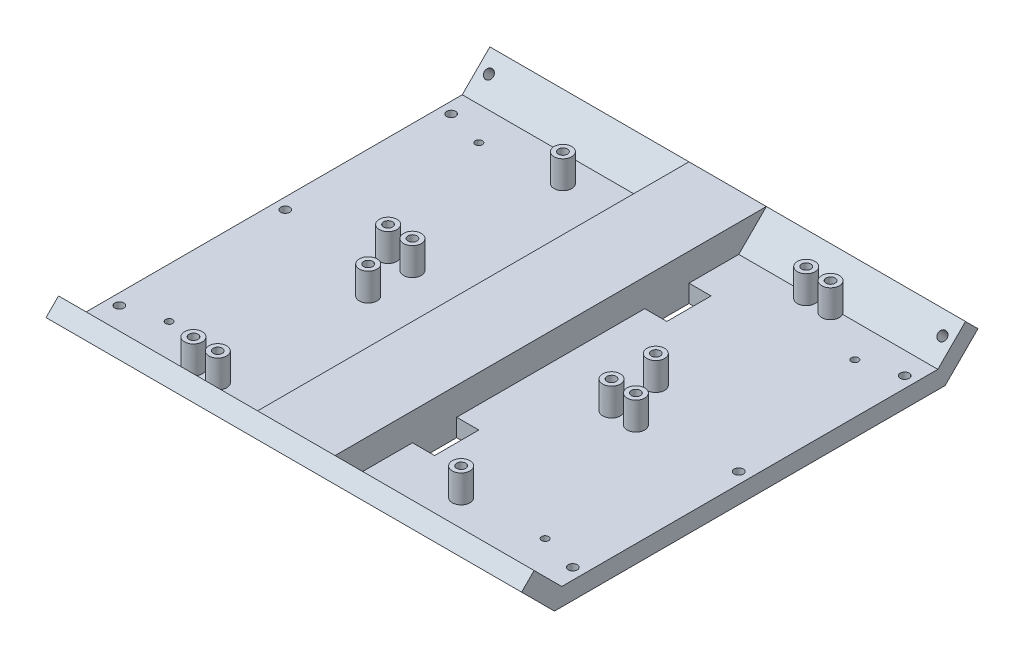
ISO-10303-21;
HEADER;
FILE_DESCRIPTION(('STEP AP214'),'2;1');
FILE_NAME('part.step','',(''),(''),'','','');
FILE_SCHEMA(('AUTOMOTIVE_DESIGN { 1 0 10303 214 1 1 1 1 }'));
ENDSEC;
DATA;
#1=APPLICATION_CONTEXT('core data for automotive mechanical design processes');
#2=APPLICATION_PROTOCOL_DEFINITION('international standard','automotive_design',2000,#1);
#3=PRODUCT_CONTEXT('',#1,'mechanical');
#4=PRODUCT('Part','Part','',(#3));
#5=PRODUCT_RELATED_PRODUCT_CATEGORY('part','',(#4));
#6=PRODUCT_DEFINITION_FORMATION('','',#4);
#7=PRODUCT_DEFINITION_CONTEXT('part definition',#1,'design');
#8=PRODUCT_DEFINITION('design','',#6,#7);
#9=PRODUCT_DEFINITION_SHAPE('','',#8);
#10=(LENGTH_UNIT() NAMED_UNIT(*) SI_UNIT(.MILLI.,.METRE.));
#11=(NAMED_UNIT(*) PLANE_ANGLE_UNIT() SI_UNIT($,.RADIAN.));
#12=(NAMED_UNIT(*) SI_UNIT($,.STERADIAN.) SOLID_ANGLE_UNIT());
#13=UNCERTAINTY_MEASURE_WITH_UNIT(LENGTH_MEASURE(1.E-05),#10,'distance_accuracy_value','');
#14=(GEOMETRIC_REPRESENTATION_CONTEXT(3) GLOBAL_UNCERTAINTY_ASSIGNED_CONTEXT((#13)) GLOBAL_UNIT_ASSIGNED_CONTEXT((#10,
#11,#12)) REPRESENTATION_CONTEXT('',''));
#15=CARTESIAN_POINT('',(0.,0.,0.));
#16=DIRECTION('',(0.,0.,1.));
#17=DIRECTION('',(1.,0.,0.));
#18=AXIS2_PLACEMENT_3D('',#15,#16,#17);
#19=CARTESIAN_POINT('',(107.5,0.,85.0000000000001));
#20=DIRECTION('',(0.,-1.,0.));
#21=DIRECTION('',(0.,0.,-1.));
#22=AXIS2_PLACEMENT_3D('',#19,#20,#21);
#23=PLANE('',#22);
#24=CARTESIAN_POINT('',(-85.,0.,-70.));
#25=DIRECTION('',(0.,-1.,0.));
#26=DIRECTION('',(0.,0.,-1.));
#27=AXIS2_PLACEMENT_3D('',#24,#25,#26);
#28=CIRCLE('',#27,1.60000000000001);
#29=CARTESIAN_POINT('',(-85.,0.,-71.6));
#30=VERTEX_POINT('',#29);
#31=EDGE_CURVE('E1651',#30,#30,#28,.T.);
#32=ORIENTED_EDGE('',*,*,#31,.T.);
#33=EDGE_LOOP('',(#32));
#34=FACE_BOUND('',#33,.T.);
#35=CARTESIAN_POINT('',(-85.,0.,70.));
#36=DIRECTION('',(0.,-1.,0.));
#37=DIRECTION('',(0.,0.,-1.));
#38=AXIS2_PLACEMENT_3D('',#35,#36,#37);
#39=CIRCLE('',#38,1.60000000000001);
#40=CARTESIAN_POINT('',(-85.,0.,68.4));
#41=VERTEX_POINT('',#40);
#42=EDGE_CURVE('E313',#41,#41,#39,.F.);
#43=ORIENTED_EDGE('',*,*,#42,.F.);
#44=EDGE_LOOP('',(#43));
#45=FACE_BOUND('',#44,.T.);
#46=CARTESIAN_POINT('',(-61.,0.,-5.));
#47=DIRECTION('',(0.,-1.,0.));
#48=DIRECTION('',(0.,0.,-1.));
#49=AXIS2_PLACEMENT_3D('',#46,#47,#48);
#50=CIRCLE('',#49,4.00000000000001);
#51=CARTESIAN_POINT('',(-61.,0.,-9.00000000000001));
#52=VERTEX_POINT('',#51);
#53=EDGE_CURVE('E419',#52,#52,#50,.F.);
#54=ORIENTED_EDGE('',*,*,#53,.F.);
#55=EDGE_LOOP('',(#54));
#56=FACE_BOUND('',#55,.T.);
#57=CARTESIAN_POINT('',(-50.,0.,-5.));
#58=DIRECTION('',(0.,-1.,0.));
#59=DIRECTION('',(0.,0.,-1.));
#60=AXIS2_PLACEMENT_3D('',#57,#58,#59);
#61=CIRCLE('',#60,4.);
#62=CARTESIAN_POINT('',(-50.,0.,-9.));
#63=VERTEX_POINT('',#62);
#64=EDGE_CURVE('E425',#63,#63,#61,.F.);
#65=ORIENTED_EDGE('',*,*,#64,.F.);
#66=EDGE_LOOP('',(#65));
#67=FACE_BOUND('',#66,.T.);
#68=CARTESIAN_POINT('',(-50.,0.,-73.));
#69=DIRECTION('',(0.,-1.,0.));
#70=DIRECTION('',(0.,0.,-1.));
#71=AXIS2_PLACEMENT_3D('',#68,#69,#70);
#72=CIRCLE('',#71,4.00000000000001);
#73=CARTESIAN_POINT('',(-50.,0.,-77.));
#74=VERTEX_POINT('',#73);
#75=EDGE_CURVE('E431',#74,#74,#72,.F.);
#76=ORIENTED_EDGE('',*,*,#75,.F.);
#77=EDGE_LOOP('',(#76));
#78=FACE_BOUND('',#77,.T.);
#79=CARTESIAN_POINT('',(-50.,0.,15.));
#80=DIRECTION('',(0.,-1.,0.));
#81=DIRECTION('',(0.,0.,-1.));
#82=AXIS2_PLACEMENT_3D('',#79,#80,#81);
#83=CIRCLE('',#82,4.);
#84=CARTESIAN_POINT('',(-50.,0.,11.));
#85=VERTEX_POINT('',#84);
#86=EDGE_CURVE('E450',#85,#85,#83,.F.);
#87=ORIENTED_EDGE('',*,*,#86,.F.);
#88=EDGE_LOOP('',(#87));
#89=FACE_BOUND('',#88,.T.);
#90=CARTESIAN_POINT('',(-102.5,0.,75.0000000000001));
#91=DIRECTION('',(0.,1.,0.));
#92=DIRECTION('',(0.,0.,1.));
#93=AXIS2_PLACEMENT_3D('',#90,#91,#92);
#94=CIRCLE('',#93,2.04999999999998);
#95=CARTESIAN_POINT('',(-102.5,0.,77.0500000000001));
#96=VERTEX_POINT('',#95);
#97=EDGE_CURVE('E618',#96,#96,#94,.T.);
#98=ORIENTED_EDGE('',*,*,#97,.F.);
#99=EDGE_LOOP('',(#98));
#100=FACE_BOUND('',#99,.T.);
#101=CARTESIAN_POINT('',(-102.5,0.,0.));
#102=DIRECTION('',(0.,1.,0.));
#103=DIRECTION('',(0.,0.,1.));
#104=AXIS2_PLACEMENT_3D('',#101,#102,#103);
#105=CIRCLE('',#104,2.04999999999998);
#106=CARTESIAN_POINT('',(-102.5,0.,2.04999999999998));
#107=VERTEX_POINT('',#106);
#108=EDGE_CURVE('E612',#107,#107,#105,.T.);
#109=ORIENTED_EDGE('',*,*,#108,.F.);
#110=EDGE_LOOP('',(#109));
#111=FACE_BOUND('',#110,.T.);
#112=CARTESIAN_POINT('',(-102.5,0.,-75.0000000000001));
#113=DIRECTION('',(0.,1.,0.));
#114=DIRECTION('',(0.,0.,1.));
#115=AXIS2_PLACEMENT_3D('',#112,#113,#114);
#116=CIRCLE('',#115,2.04999999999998);
#117=CARTESIAN_POINT('',(-102.5,0.,-72.9500000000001));
#118=VERTEX_POINT('',#117);
#119=EDGE_CURVE('E606',#118,#118,#116,.T.);
#120=ORIENTED_EDGE('',*,*,#119,.F.);
#121=EDGE_LOOP('',(#120));
#122=FACE_BOUND('',#121,.T.);
#123=DIRECTION('',(-1.,0.,0.));
#124=VECTOR('',#123,1.);
#125=CARTESIAN_POINT('',(107.5,0.,85.0000000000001));
#126=LINE('',#125,#124);
#127=CARTESIAN_POINT('',(-64.4641016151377,0.,85.0000000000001));
#128=VERTEX_POINT('',#127);
#129=CARTESIAN_POINT('',(-107.5,0.,85.0000000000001));
#130=VERTEX_POINT('',#129);
#131=EDGE_CURVE('E694',#128,#130,#126,.T.);
#132=ORIENTED_EDGE('',*,*,#131,.F.);
#133=CARTESIAN_POINT('',(-61.,0.,83.));
#134=DIRECTION('',(0.,-1.,0.));
#135=DIRECTION('',(0.,0.,-1.));
#136=AXIS2_PLACEMENT_3D('',#133,#134,#135);
#137=CIRCLE('',#136,4.00000000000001);
#138=CARTESIAN_POINT('',(-57.5358983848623,0.,85.0000000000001));
#139=VERTEX_POINT('',#138);
#140=EDGE_CURVE('E437',#139,#128,#137,.F.);
#141=ORIENTED_EDGE('',*,*,#140,.F.);
#142=CARTESIAN_POINT('',(-53.4641016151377,0.,85.0000000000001));
#143=VERTEX_POINT('',#142);
#144=EDGE_CURVE('E702',#143,#139,#126,.T.);
#145=ORIENTED_EDGE('',*,*,#144,.F.);
#146=CARTESIAN_POINT('',(-50.,0.,83.));
#147=DIRECTION('',(0.,-1.,0.));
#148=DIRECTION('',(0.,0.,-1.));
#149=AXIS2_PLACEMENT_3D('',#146,#147,#148);
#150=CIRCLE('',#149,4.);
#151=CARTESIAN_POINT('',(-46.5358983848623,0.,85.0000000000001));
#152=VERTEX_POINT('',#151);
#153=EDGE_CURVE('E442',#152,#143,#150,.F.);
#154=ORIENTED_EDGE('',*,*,#153,.F.);
#155=CARTESIAN_POINT('',(-17.5,0.,85.0000000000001));
#156=VERTEX_POINT('',#155);
#157=EDGE_CURVE('E696',#156,#152,#126,.T.);
#158=ORIENTED_EDGE('',*,*,#157,.F.);
#159=DIRECTION('',(0.,0.,-1.));
#160=VECTOR('',#159,1.);
#161=CARTESIAN_POINT('',(-17.5,0.,-85.0000000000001));
#162=LINE('',#161,#160);
#163=CARTESIAN_POINT('',(-17.5,0.,62.5));
#164=VERTEX_POINT('',#163);
#165=EDGE_CURVE('E468',#156,#164,#162,.T.);
#166=ORIENTED_EDGE('',*,*,#165,.T.);
#167=DIRECTION('',(1.,0.,0.));
#168=VECTOR('',#167,1.);
#169=CARTESIAN_POINT('',(-17.5,0.,62.5));
#170=LINE('',#169,#168);
#171=CARTESIAN_POINT('',(-27.5,0.,62.5));
#172=VERTEX_POINT('',#171);
#173=EDGE_CURVE('E494',#172,#164,#170,.T.);
#174=ORIENTED_EDGE('',*,*,#173,.F.);
#175=DIRECTION('',(0.,0.,1.));
#176=VECTOR('',#175,1.);
#177=CARTESIAN_POINT('',(-27.5,0.,62.5));
#178=LINE('',#177,#176);
#179=CARTESIAN_POINT('',(-27.5,0.,42.5));
#180=VERTEX_POINT('',#179);
#181=EDGE_CURVE('E478',#180,#172,#178,.T.);
#182=ORIENTED_EDGE('',*,*,#181,.F.);
#183=DIRECTION('',(-1.,0.,0.));
#184=VECTOR('',#183,1.);
#185=CARTESIAN_POINT('',(-17.5,0.,42.5));
#186=LINE('',#185,#184);
#187=CARTESIAN_POINT('',(-17.5,0.,42.5));
#188=VERTEX_POINT('',#187);
#189=EDGE_CURVE('E483',#188,#180,#186,.T.);
#190=ORIENTED_EDGE('',*,*,#189,.F.);
#191=CARTESIAN_POINT('',(-17.5,0.,-42.5));
#192=VERTEX_POINT('',#191);
#193=EDGE_CURVE('E471',#188,#192,#162,.T.);
#194=ORIENTED_EDGE('',*,*,#193,.T.);
#195=DIRECTION('',(-1.,0.,0.));
#196=VECTOR('',#195,1.);
#197=CARTESIAN_POINT('',(-17.5,0.,-42.5));
#198=LINE('',#197,#196);
#199=CARTESIAN_POINT('',(-27.5,0.,-42.5));
#200=VERTEX_POINT('',#199);
#201=EDGE_CURVE('E523',#192,#200,#198,.T.);
#202=ORIENTED_EDGE('',*,*,#201,.T.);
#203=DIRECTION('',(0.,0.,-1.));
#204=VECTOR('',#203,1.);
#205=CARTESIAN_POINT('',(-27.5,0.,-62.5));
#206=LINE('',#205,#204);
#207=CARTESIAN_POINT('',(-27.5,0.,-62.5));
#208=VERTEX_POINT('',#207);
#209=EDGE_CURVE('E501',#200,#208,#206,.T.);
#210=ORIENTED_EDGE('',*,*,#209,.T.);
#211=DIRECTION('',(1.,0.,0.));
#212=VECTOR('',#211,1.);
#213=CARTESIAN_POINT('',(-17.5,0.,-62.5));
#214=LINE('',#213,#212);
#215=CARTESIAN_POINT('',(-17.5,0.,-62.5));
#216=VERTEX_POINT('',#215);
#217=EDGE_CURVE('E513',#208,#216,#214,.T.);
#218=ORIENTED_EDGE('',*,*,#217,.T.);
#219=CARTESIAN_POINT('',(-17.5,0.,-85.0000000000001));
#220=VERTEX_POINT('',#219);
#221=EDGE_CURVE('E467',#216,#220,#162,.T.);
#222=ORIENTED_EDGE('',*,*,#221,.T.);
#223=DIRECTION('',(-1.,0.,0.));
#224=VECTOR('',#223,1.);
#225=CARTESIAN_POINT('',(107.5,0.,-85.0000000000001));
#226=LINE('',#225,#224);
#227=CARTESIAN_POINT('',(-107.5,0.,-85.0000000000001));
#228=VERTEX_POINT('',#227);
#229=EDGE_CURVE('E263',#220,#228,#226,.T.);
#230=ORIENTED_EDGE('',*,*,#229,.T.);
#231=DIRECTION('',(0.,0.,1.));
#232=VECTOR('',#231,1.);
#233=CARTESIAN_POINT('',(-107.5,0.,85.0000000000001));
#234=LINE('',#233,#232);
#235=EDGE_CURVE('E687',#228,#130,#234,.T.);
#236=ORIENTED_EDGE('',*,*,#235,.T.);
#237=EDGE_LOOP('',(#132,#141,#145,#154,#158,#166,#174,#182,#190,#194,#202,#210,#218,#222,#230,#236));
#238=FACE_BOUND('',#237,.T.);
#239=ADVANCED_FACE('F38',(#34,#45,#56,#67,#78,#89,#100,#111,#122,#238),#23,.F.);
#240=CARTESIAN_POINT('',(107.5,0.,-85.0000000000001));
#241=DIRECTION('',(0.,-0.707106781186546,-0.707106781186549));
#242=DIRECTION('',(0.,0.707106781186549,-0.707106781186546));
#243=AXIS2_PLACEMENT_3D('',#240,#241,#242);
#244=PLANE('',#243);
#245=CARTESIAN_POINT('',(-102.5,7.07106781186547,-92.0710678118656));
#246=DIRECTION('',(0.,0.707106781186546,0.707106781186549));
#247=DIRECTION('',(0.,-0.707106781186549,0.707106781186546));
#248=AXIS2_PLACEMENT_3D('',#245,#246,#247);
#249=CIRCLE('',#248,2.04999999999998);
#250=CARTESIAN_POINT('',(-102.5,5.62149891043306,-90.6214989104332));
#251=VERTEX_POINT('',#250);
#252=EDGE_CURVE('E592',#251,#251,#249,.T.);
#253=ORIENTED_EDGE('',*,*,#252,.F.);
#254=EDGE_LOOP('',(#253));
#255=FACE_BOUND('',#254,.T.);
#256=DIRECTION('',(0.,0.707106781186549,-0.707106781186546));
#257=VECTOR('',#256,1.);
#258=CARTESIAN_POINT('',(-17.5,12.5,-97.5));
#259=LINE('',#258,#257);
#260=CARTESIAN_POINT('',(-17.5,12.5,-97.5));
#261=VERTEX_POINT('',#260);
#262=EDGE_CURVE('E470',#220,#261,#259,.T.);
#263=ORIENTED_EDGE('',*,*,#262,.T.);
#264=DIRECTION('',(-1.,0.,0.));
#265=VECTOR('',#264,1.);
#266=CARTESIAN_POINT('',(107.5,12.5,-97.5));
#267=LINE('',#266,#265);
#268=CARTESIAN_POINT('',(-107.5,12.5,-97.5));
#269=VERTEX_POINT('',#268);
#270=EDGE_CURVE('E270',#261,#269,#267,.T.);
#271=ORIENTED_EDGE('',*,*,#270,.T.);
#272=DIRECTION('',(0.,-0.707106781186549,0.707106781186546));
#273=VECTOR('',#272,1.);
#274=CARTESIAN_POINT('',(-107.5,0.,-85.0000000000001));
#275=LINE('',#274,#273);
#276=EDGE_CURVE('E685',#269,#228,#275,.T.);
#277=ORIENTED_EDGE('',*,*,#276,.T.);
#278=ORIENTED_EDGE('',*,*,#229,.F.);
#279=EDGE_LOOP('',(#263,#271,#277,#278));
#280=FACE_BOUND('',#279,.T.);
#281=ADVANCED_FACE('F734',(#255,#280),#244,.F.);
#282=CARTESIAN_POINT('',(107.5,0.,85.0000000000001));
#283=DIRECTION('',(0.,-0.707106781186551,0.707106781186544));
#284=DIRECTION('',(0.,-0.707106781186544,-0.707106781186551));
#285=AXIS2_PLACEMENT_3D('',#282,#283,#284);
#286=PLANE('',#285);
#287=CARTESIAN_POINT('',(-102.5,7.07106781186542,92.0710678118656));
#288=DIRECTION('',(0.,0.707106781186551,-0.707106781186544));
#289=DIRECTION('',(0.,0.707106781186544,0.707106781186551));
#290=AXIS2_PLACEMENT_3D('',#287,#288,#289);
#291=CIRCLE('',#290,2.04999999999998);
#292=CARTESIAN_POINT('',(-102.5,8.52063671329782,93.520636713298));
#293=VERTEX_POINT('',#292);
#294=EDGE_CURVE('E624',#293,#293,#291,.T.);
#295=ORIENTED_EDGE('',*,*,#294,.F.);
#296=EDGE_LOOP('',(#295));
#297=FACE_BOUND('',#296,.T.);
#298=ORIENTED_EDGE('',*,*,#144,.T.);
#299=CARTESIAN_POINT('',(-61.,-2.00000000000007,83.));
#300=DIRECTION('',(0.,-0.707106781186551,0.707106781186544));
#301=DIRECTION('',(0.,0.707106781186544,0.707106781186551));
#302=AXIS2_PLACEMENT_3D('',#299,#300,#301);
#303=ELLIPSE('',#302,5.65685424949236,4.00000000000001);
#304=EDGE_CURVE('E300',#139,#128,#303,.T.);
#305=ORIENTED_EDGE('',*,*,#304,.T.);
#306=ORIENTED_EDGE('',*,*,#131,.T.);
#307=DIRECTION('',(0.,0.707106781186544,0.707106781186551));
#308=VECTOR('',#307,1.);
#309=CARTESIAN_POINT('',(-107.5,0.,85.0000000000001));
#310=LINE('',#309,#308);
#311=CARTESIAN_POINT('',(-107.5,12.4999999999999,97.5000000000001));
#312=VERTEX_POINT('',#311);
#313=EDGE_CURVE('E660',#130,#312,#310,.T.);
#314=ORIENTED_EDGE('',*,*,#313,.T.);
#315=DIRECTION('',(-1.,0.,0.));
#316=VECTOR('',#315,1.);
#317=CARTESIAN_POINT('',(107.5,12.4999999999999,97.5000000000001));
#318=LINE('',#317,#316);
#319=CARTESIAN_POINT('',(-17.5,12.4999999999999,97.5000000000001));
#320=VERTEX_POINT('',#319);
#321=EDGE_CURVE('E674',#320,#312,#318,.T.);
#322=ORIENTED_EDGE('',*,*,#321,.F.);
#323=DIRECTION('',(0.,-0.707106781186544,-0.707106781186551));
#324=VECTOR('',#323,1.);
#325=CARTESIAN_POINT('',(-17.5,0.,85.0000000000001));
#326=LINE('',#325,#324);
#327=EDGE_CURVE('E453',#320,#156,#326,.T.);
#328=ORIENTED_EDGE('',*,*,#327,.T.);
#329=ORIENTED_EDGE('',*,*,#157,.T.);
#330=CARTESIAN_POINT('',(-50.,-2.00000000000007,83.));
#331=DIRECTION('',(0.,-0.707106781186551,0.707106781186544));
#332=DIRECTION('',(0.,0.707106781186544,0.707106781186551));
#333=AXIS2_PLACEMENT_3D('',#330,#331,#332);
#334=ELLIPSE('',#333,5.65685424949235,4.);
#335=EDGE_CURVE('E292',#152,#143,#334,.T.);
#336=ORIENTED_EDGE('',*,*,#335,.T.);
#337=EDGE_LOOP('',(#298,#305,#306,#314,#322,#328,#329,#336));
#338=FACE_BOUND('',#337,.T.);
#339=ADVANCED_FACE('F707',(#297,#338),#286,.F.);
#340=CARTESIAN_POINT('',(107.5,-8.,88.313708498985));
#341=DIRECTION('',(0.,1.,0.));
#342=DIRECTION('',(0.,0.,1.));
#343=AXIS2_PLACEMENT_3D('',#340,#341,#342);
#344=PLANE('',#343);
#345=CARTESIAN_POINT('',(-85.,-8.,-70.));
#346=DIRECTION('',(0.,-1.,0.));
#347=DIRECTION('',(0.,0.,1.));
#348=AXIS2_PLACEMENT_3D('',#345,#346,#347);
#349=CIRCLE('',#348,1.60000000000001);
#350=CARTESIAN_POINT('',(-85.,-8.,-68.4));
#351=VERTEX_POINT('',#350);
#352=EDGE_CURVE('E1649',#351,#351,#349,.T.);
#353=ORIENTED_EDGE('',*,*,#352,.F.);
#354=EDGE_LOOP('',(#353));
#355=FACE_BOUND('',#354,.T.);
#356=CARTESIAN_POINT('',(85.,-8.,-70.));
#357=DIRECTION('',(0.,1.,0.));
#358=DIRECTION('',(0.,0.,1.));
#359=AXIS2_PLACEMENT_3D('',#356,#357,#358);
#360=CIRCLE('',#359,1.60000000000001);
#361=CARTESIAN_POINT('',(85.,-8.,-68.4));
#362=VERTEX_POINT('',#361);
#363=EDGE_CURVE('E1652',#362,#362,#360,.T.);
#364=ORIENTED_EDGE('',*,*,#363,.T.);
#365=EDGE_LOOP('',(#364));
#366=FACE_BOUND('',#365,.T.);
#367=CARTESIAN_POINT('',(-85.,-8.,70.));
#368=DIRECTION('',(0.,1.,0.));
#369=DIRECTION('',(0.,0.,-1.));
#370=AXIS2_PLACEMENT_3D('',#367,#368,#369);
#371=CIRCLE('',#370,1.60000000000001);
#372=CARTESIAN_POINT('',(-85.,-8.,68.4));
#373=VERTEX_POINT('',#372);
#374=EDGE_CURVE('E318',#373,#373,#371,.T.);
#375=ORIENTED_EDGE('',*,*,#374,.T.);
#376=EDGE_LOOP('',(#375));
#377=FACE_BOUND('',#376,.T.);
#378=CARTESIAN_POINT('',(85.,-8.,70.));
#379=DIRECTION('',(0.,-1.,0.));
#380=DIRECTION('',(0.,0.,-1.));
#381=AXIS2_PLACEMENT_3D('',#378,#379,#380);
#382=CIRCLE('',#381,1.60000000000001);
#383=CARTESIAN_POINT('',(85.,-8.,68.4));
#384=VERTEX_POINT('',#383);
#385=EDGE_CURVE('E306',#384,#384,#382,.T.);
#386=ORIENTED_EDGE('',*,*,#385,.F.);
#387=EDGE_LOOP('',(#386));
#388=FACE_BOUND('',#387,.T.);
#389=DIRECTION('',(-1.,0.,0.));
#390=VECTOR('',#389,1.);
#391=CARTESIAN_POINT('',(-17.5,-8.,42.5));
#392=LINE('',#391,#390);
#393=CARTESIAN_POINT('',(-17.5,-8.,42.5));
#394=VERTEX_POINT('',#393);
#395=CARTESIAN_POINT('',(-27.5,-8.,42.5));
#396=VERTEX_POINT('',#395);
#397=EDGE_CURVE('E489',#394,#396,#392,.T.);
#398=ORIENTED_EDGE('',*,*,#397,.T.);
#399=DIRECTION('',(0.,0.,1.));
#400=VECTOR('',#399,1.);
#401=CARTESIAN_POINT('',(-27.5,-8.,62.5));
#402=LINE('',#401,#400);
#403=CARTESIAN_POINT('',(-27.5,-8.,62.5));
#404=VERTEX_POINT('',#403);
#405=EDGE_CURVE('E479',#396,#404,#402,.T.);
#406=ORIENTED_EDGE('',*,*,#405,.T.);
#407=DIRECTION('',(1.,0.,0.));
#408=VECTOR('',#407,1.);
#409=CARTESIAN_POINT('',(-17.5,-8.,62.5));
#410=LINE('',#409,#408);
#411=CARTESIAN_POINT('',(-17.5,-8.,62.5));
#412=VERTEX_POINT('',#411);
#413=EDGE_CURVE('E482',#404,#412,#410,.T.);
#414=ORIENTED_EDGE('',*,*,#413,.T.);
#415=DIRECTION('',(0.,0.,-1.));
#416=VECTOR('',#415,1.);
#417=CARTESIAN_POINT('',(-17.5,-8.,62.5));
#418=LINE('',#417,#416);
#419=EDGE_CURVE('E486',#412,#394,#418,.T.);
#420=ORIENTED_EDGE('',*,*,#419,.T.);
#421=EDGE_LOOP('',(#398,#406,#414,#420));
#422=FACE_BOUND('',#421,.T.);
#423=DIRECTION('',(0.,0.,1.));
#424=VECTOR('',#423,1.);
#425=CARTESIAN_POINT('',(27.5,-8.,62.5));
#426=LINE('',#425,#424);
#427=CARTESIAN_POINT('',(27.5,-8.,42.5));
#428=VERTEX_POINT('',#427);
#429=CARTESIAN_POINT('',(27.5,-8.,62.5));
#430=VERTEX_POINT('',#429);
#431=EDGE_CURVE('E540',#428,#430,#426,.T.);
#432=ORIENTED_EDGE('',*,*,#431,.F.);
#433=DIRECTION('',(1.,0.,0.));
#434=VECTOR('',#433,1.);
#435=CARTESIAN_POINT('',(17.5,-8.,42.5));
#436=LINE('',#435,#434);
#437=CARTESIAN_POINT('',(17.5,-8.,42.5));
#438=VERTEX_POINT('',#437);
#439=EDGE_CURVE('E542',#438,#428,#436,.T.);
#440=ORIENTED_EDGE('',*,*,#439,.F.);
#441=DIRECTION('',(0.,0.,-1.));
#442=VECTOR('',#441,1.);
#443=CARTESIAN_POINT('',(17.5,-8.,62.5));
#444=LINE('',#443,#442);
#445=CARTESIAN_POINT('',(17.5,-8.,62.5));
#446=VERTEX_POINT('',#445);
#447=EDGE_CURVE('E545',#446,#438,#444,.T.);
#448=ORIENTED_EDGE('',*,*,#447,.F.);
#449=DIRECTION('',(-1.,0.,0.));
#450=VECTOR('',#449,1.);
#451=CARTESIAN_POINT('',(17.5,-8.,62.5));
#452=LINE('',#451,#450);
#453=EDGE_CURVE('E548',#430,#446,#452,.T.);
#454=ORIENTED_EDGE('',*,*,#453,.F.);
#455=EDGE_LOOP('',(#432,#440,#448,#454));
#456=FACE_BOUND('',#455,.T.);
#457=DIRECTION('',(1.,0.,0.));
#458=VECTOR('',#457,1.);
#459=CARTESIAN_POINT('',(17.5,-8.,-42.5));
#460=LINE('',#459,#458);
#461=CARTESIAN_POINT('',(17.5,-8.,-42.5));
#462=VERTEX_POINT('',#461);
#463=CARTESIAN_POINT('',(27.5,-8.,-42.5));
#464=VERTEX_POINT('',#463);
#465=EDGE_CURVE('E580',#462,#464,#460,.T.);
#466=ORIENTED_EDGE('',*,*,#465,.T.);
#467=DIRECTION('',(0.,0.,-1.));
#468=VECTOR('',#467,1.);
#469=CARTESIAN_POINT('',(27.5,-8.,-62.5));
#470=LINE('',#469,#468);
#471=CARTESIAN_POINT('',(27.5,-8.,-62.5));
#472=VERTEX_POINT('',#471);
#473=EDGE_CURVE('E570',#464,#472,#470,.T.);
#474=ORIENTED_EDGE('',*,*,#473,.T.);
#475=DIRECTION('',(-1.,0.,0.));
#476=VECTOR('',#475,1.);
#477=CARTESIAN_POINT('',(17.5,-8.,-62.5));
#478=LINE('',#477,#476);
#479=CARTESIAN_POINT('',(17.5,-8.,-62.5));
#480=VERTEX_POINT('',#479);
#481=EDGE_CURVE('E573',#472,#480,#478,.T.);
#482=ORIENTED_EDGE('',*,*,#481,.T.);
#483=DIRECTION('',(0.,0.,1.));
#484=VECTOR('',#483,1.);
#485=CARTESIAN_POINT('',(17.5,-8.,-62.5));
#486=LINE('',#485,#484);
#487=EDGE_CURVE('E577',#480,#462,#486,.T.);
#488=ORIENTED_EDGE('',*,*,#487,.T.);
#489=EDGE_LOOP('',(#466,#474,#482,#488));
#490=FACE_BOUND('',#489,.T.);
#491=CARTESIAN_POINT('',(-102.5,-8.,-75.0000000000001));
#492=DIRECTION('',(0.,1.,0.));
#493=DIRECTION('',(0.,0.,1.));
#494=AXIS2_PLACEMENT_3D('',#491,#492,#493);
#495=CIRCLE('',#494,2.05);
#496=CARTESIAN_POINT('',(-102.5,-8.,-72.9500000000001));
#497=VERTEX_POINT('',#496);
#498=EDGE_CURVE('E609',#497,#497,#495,.T.);
#499=ORIENTED_EDGE('',*,*,#498,.T.);
#500=EDGE_LOOP('',(#499));
#501=FACE_BOUND('',#500,.T.);
#502=CARTESIAN_POINT('',(-102.5,-8.,0.));
#503=DIRECTION('',(0.,1.,0.));
#504=DIRECTION('',(0.,0.,1.));
#505=AXIS2_PLACEMENT_3D('',#502,#503,#504);
#506=CIRCLE('',#505,2.05);
#507=CARTESIAN_POINT('',(-102.5,-8.,2.05));
#508=VERTEX_POINT('',#507);
#509=EDGE_CURVE('E615',#508,#508,#506,.T.);
#510=ORIENTED_EDGE('',*,*,#509,.T.);
#511=EDGE_LOOP('',(#510));
#512=FACE_BOUND('',#511,.T.);
#513=CARTESIAN_POINT('',(-102.5,-8.,75.0000000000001));
#514=DIRECTION('',(0.,1.,0.));
#515=DIRECTION('',(0.,0.,1.));
#516=AXIS2_PLACEMENT_3D('',#513,#514,#515);
#517=CIRCLE('',#516,2.05);
#518=CARTESIAN_POINT('',(-102.5,-8.,77.0500000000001));
#519=VERTEX_POINT('',#518);
#520=EDGE_CURVE('E621',#519,#519,#517,.T.);
#521=ORIENTED_EDGE('',*,*,#520,.T.);
#522=EDGE_LOOP('',(#521));
#523=FACE_BOUND('',#522,.T.);
#524=CARTESIAN_POINT('',(102.5,-8.,75.0000000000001));
#525=DIRECTION('',(0.,1.,0.));
#526=DIRECTION('',(0.,0.,1.));
#527=AXIS2_PLACEMENT_3D('',#524,#525,#526);
#528=CIRCLE('',#527,2.05);
#529=CARTESIAN_POINT('',(102.5,-8.,77.0500000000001));
#530=VERTEX_POINT('',#529);
#531=EDGE_CURVE('E634',#530,#530,#528,.T.);
#532=ORIENTED_EDGE('',*,*,#531,.T.);
#533=EDGE_LOOP('',(#532));
#534=FACE_BOUND('',#533,.T.);
#535=CARTESIAN_POINT('',(102.5,-8.,0.));
#536=DIRECTION('',(0.,1.,0.));
#537=DIRECTION('',(0.,0.,1.));
#538=AXIS2_PLACEMENT_3D('',#535,#536,#537);
#539=CIRCLE('',#538,2.05);
#540=CARTESIAN_POINT('',(102.5,-8.,2.05));
#541=VERTEX_POINT('',#540);
#542=EDGE_CURVE('E640',#541,#541,#539,.T.);
#543=ORIENTED_EDGE('',*,*,#542,.T.);
#544=EDGE_LOOP('',(#543));
#545=FACE_BOUND('',#544,.T.);
#546=CARTESIAN_POINT('',(102.5,-8.,-75.0000000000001));
#547=DIRECTION('',(0.,1.,0.));
#548=DIRECTION('',(0.,0.,1.));
#549=AXIS2_PLACEMENT_3D('',#546,#547,#548);
#550=CIRCLE('',#549,2.05);
#551=CARTESIAN_POINT('',(102.5,-8.,-72.9500000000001));
#552=VERTEX_POINT('',#551);
#553=EDGE_CURVE('E646',#552,#552,#550,.T.);
#554=ORIENTED_EDGE('',*,*,#553,.T.);
#555=EDGE_LOOP('',(#554));
#556=FACE_BOUND('',#555,.T.);
#557=DIRECTION('',(0.,0.,-1.));
#558=VECTOR('',#557,1.);
#559=CARTESIAN_POINT('',(-107.5,-8.,88.313708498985));
#560=LINE('',#559,#558);
#561=CARTESIAN_POINT('',(-107.5,-8.,88.313708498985));
#562=VERTEX_POINT('',#561);
#563=CARTESIAN_POINT('',(-107.5,-8.,-88.3137084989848));
#564=VERTEX_POINT('',#563);
#565=EDGE_CURVE('E679',#562,#564,#560,.T.);
#566=ORIENTED_EDGE('',*,*,#565,.T.);
#567=DIRECTION('',(-1.,0.,0.));
#568=VECTOR('',#567,1.);
#569=CARTESIAN_POINT('',(107.5,-8.,-88.3137084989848));
#570=LINE('',#569,#568);
#571=CARTESIAN_POINT('',(107.5,-8.,-88.3137084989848));
#572=VERTEX_POINT('',#571);
#573=EDGE_CURVE('E283',#572,#564,#570,.T.);
#574=ORIENTED_EDGE('',*,*,#573,.F.);
#575=DIRECTION('',(0.,0.,-1.));
#576=VECTOR('',#575,1.);
#577=CARTESIAN_POINT('',(107.5,-8.,88.313708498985));
#578=LINE('',#577,#576);
#579=CARTESIAN_POINT('',(107.5,-8.,88.313708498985));
#580=VERTEX_POINT('',#579);
#581=EDGE_CURVE('E662',#580,#572,#578,.T.);
#582=ORIENTED_EDGE('',*,*,#581,.F.);
#583=DIRECTION('',(-1.,0.,0.));
#584=VECTOR('',#583,1.);
#585=CARTESIAN_POINT('',(107.5,-8.,88.313708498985));
#586=LINE('',#585,#584);
#587=EDGE_CURVE('E286',#580,#562,#586,.T.);
#588=ORIENTED_EDGE('',*,*,#587,.T.);
#589=EDGE_LOOP('',(#566,#574,#582,#588));
#590=FACE_BOUND('',#589,.T.);
#591=DIRECTION('',(0.,0.,-1.));
#592=VECTOR('',#591,1.);
#593=CARTESIAN_POINT('',(-27.5,-8.,-62.5));
#594=LINE('',#593,#592);
#595=CARTESIAN_POINT('',(-27.5,-8.,-42.5));
#596=VERTEX_POINT('',#595);
#597=CARTESIAN_POINT('',(-27.5,-8.,-62.5));
#598=VERTEX_POINT('',#597);
#599=EDGE_CURVE('E510',#596,#598,#594,.T.);
#600=ORIENTED_EDGE('',*,*,#599,.F.);
#601=DIRECTION('',(-1.,0.,0.));
#602=VECTOR('',#601,1.);
#603=CARTESIAN_POINT('',(-17.5,-8.,-42.5));
#604=LINE('',#603,#602);
#605=CARTESIAN_POINT('',(-17.5,-8.,-42.5));
#606=VERTEX_POINT('',#605);
#607=EDGE_CURVE('E512',#606,#596,#604,.T.);
#608=ORIENTED_EDGE('',*,*,#607,.F.);
#609=DIRECTION('',(0.,0.,1.));
#610=VECTOR('',#609,1.);
#611=CARTESIAN_POINT('',(-17.5,-8.,-62.5));
#612=LINE('',#611,#610);
#613=CARTESIAN_POINT('',(-17.5,-8.,-62.5));
#614=VERTEX_POINT('',#613);
#615=EDGE_CURVE('E515',#614,#606,#612,.T.);
#616=ORIENTED_EDGE('',*,*,#615,.F.);
#617=DIRECTION('',(1.,0.,0.));
#618=VECTOR('',#617,1.);
#619=CARTESIAN_POINT('',(-17.5,-8.,-62.5));
#620=LINE('',#619,#618);
#621=EDGE_CURVE('E518',#598,#614,#620,.T.);
#622=ORIENTED_EDGE('',*,*,#621,.F.);
#623=EDGE_LOOP('',(#600,#608,#616,#622));
#624=FACE_BOUND('',#623,.T.);
#625=ADVANCED_FACE('F748',(#355,#366,#377,#388,#422,#456,#490,#501,#512,#523,#534,#545,#556,
#590,#624),#344,.F.);
#626=CARTESIAN_POINT('',(85.,0.,-70.));
#627=DIRECTION('',(0.,-1.,0.));
#628=DIRECTION('',(0.,0.,-1.));
#629=AXIS2_PLACEMENT_3D('',#626,#627,#628);
#630=CIRCLE('',#629,1.60000000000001);
#631=CARTESIAN_POINT('',(85.,0.,-71.6));
#632=VERTEX_POINT('',#631);
#633=EDGE_CURVE('E42',#632,#632,#630,.F.);
#634=ORIENTED_EDGE('',*,*,#633,.F.);
#635=EDGE_LOOP('',(#634));
#636=FACE_BOUND('',#635,.T.);
#637=CARTESIAN_POINT('',(85.,0.,70.));
#638=DIRECTION('',(0.,-1.,0.));
#639=DIRECTION('',(0.,0.,-1.));
#640=AXIS2_PLACEMENT_3D('',#637,#638,#639);
#641=CIRCLE('',#640,1.60000000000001);
#642=CARTESIAN_POINT('',(85.,0.,68.4));
#643=VERTEX_POINT('',#642);
#644=EDGE_CURVE('E303',#643,#643,#641,.T.);
#645=ORIENTED_EDGE('',*,*,#644,.T.);
#646=EDGE_LOOP('',(#645));
#647=FACE_BOUND('',#646,.T.);
#648=CARTESIAN_POINT('',(50.,0.,73.));
#649=DIRECTION('',(0.,-1.,0.));
#650=DIRECTION('',(0.,0.,-1.));
#651=AXIS2_PLACEMENT_3D('',#648,#649,#650);
#652=CIRCLE('',#651,4.00000000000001);
#653=CARTESIAN_POINT('',(50.,0.,69.));
#654=VERTEX_POINT('',#653);
#655=EDGE_CURVE('E388',#654,#654,#652,.F.);
#656=ORIENTED_EDGE('',*,*,#655,.F.);
#657=EDGE_LOOP('',(#656));
#658=FACE_BOUND('',#657,.T.);
#659=CARTESIAN_POINT('',(50.,0.,5.));
#660=DIRECTION('',(0.,-1.,0.));
#661=DIRECTION('',(0.,0.,-1.));
#662=AXIS2_PLACEMENT_3D('',#659,#660,#661);
#663=CIRCLE('',#662,4.);
#664=CARTESIAN_POINT('',(50.,0.,1.00000000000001));
#665=VERTEX_POINT('',#664);
#666=EDGE_CURVE('E396',#665,#665,#663,.F.);
#667=ORIENTED_EDGE('',*,*,#666,.F.);
#668=EDGE_LOOP('',(#667));
#669=FACE_BOUND('',#668,.T.);
#670=CARTESIAN_POINT('',(61.,0.,5.));
#671=DIRECTION('',(0.,-1.,0.));
#672=DIRECTION('',(0.,0.,-1.));
#673=AXIS2_PLACEMENT_3D('',#670,#671,#672);
#674=CIRCLE('',#673,4.00000000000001);
#675=CARTESIAN_POINT('',(61.,0.,0.999999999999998));
#676=VERTEX_POINT('',#675);
#677=EDGE_CURVE('E402',#676,#676,#674,.F.);
#678=ORIENTED_EDGE('',*,*,#677,.F.);
#679=EDGE_LOOP('',(#678));
#680=FACE_BOUND('',#679,.T.);
#681=CARTESIAN_POINT('',(50.,0.,-15.));
#682=DIRECTION('',(0.,-1.,0.));
#683=DIRECTION('',(0.,0.,-1.));
#684=AXIS2_PLACEMENT_3D('',#681,#682,#683);
#685=CIRCLE('',#684,4.00000000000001);
#686=CARTESIAN_POINT('',(50.,0.,-19.));
#687=VERTEX_POINT('',#686);
#688=EDGE_CURVE('E408',#687,#687,#685,.F.);
#689=ORIENTED_EDGE('',*,*,#688,.F.);
#690=EDGE_LOOP('',(#689));
#691=FACE_BOUND('',#690,.T.);
#692=CARTESIAN_POINT('',(57.5358983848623,0.,-85.0000000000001));
#693=VERTEX_POINT('',#692);
#694=CARTESIAN_POINT('',(53.4641016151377,0.,-85.0000000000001));
#695=VERTEX_POINT('',#694);
#696=EDGE_CURVE('E255',#693,#695,#226,.T.);
#697=ORIENTED_EDGE('',*,*,#696,.T.);
#698=CARTESIAN_POINT('',(50.,0.,-83.));
#699=DIRECTION('',(0.,-1.,0.));
#700=DIRECTION('',(0.,0.,-1.));
#701=AXIS2_PLACEMENT_3D('',#698,#699,#700);
#702=CIRCLE('',#701,4.00000000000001);
#703=CARTESIAN_POINT('',(46.5358983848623,0.,-85.0000000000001));
#704=VERTEX_POINT('',#703);
#705=EDGE_CURVE('E54',#704,#695,#702,.F.);
#706=ORIENTED_EDGE('',*,*,#705,.F.);
#707=CARTESIAN_POINT('',(17.5,0.,-85.0000000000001));
#708=VERTEX_POINT('',#707);
#709=EDGE_CURVE('E253',#704,#708,#226,.T.);
#710=ORIENTED_EDGE('',*,*,#709,.T.);
#711=DIRECTION('',(0.,0.,-1.));
#712=VECTOR('',#711,1.);
#713=CARTESIAN_POINT('',(17.5,0.,-85.0000000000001));
#714=LINE('',#713,#712);
#715=CARTESIAN_POINT('',(17.5,0.,-62.5));
#716=VERTEX_POINT('',#715);
#717=EDGE_CURVE('E456',#716,#708,#714,.T.);
#718=ORIENTED_EDGE('',*,*,#717,.F.);
#719=DIRECTION('',(-1.,0.,0.));
#720=VECTOR('',#719,1.);
#721=CARTESIAN_POINT('',(17.5,0.,-62.5));
#722=LINE('',#721,#720);
#723=CARTESIAN_POINT('',(27.5,0.,-62.5));
#724=VERTEX_POINT('',#723);
#725=EDGE_CURVE('E585',#724,#716,#722,.T.);
#726=ORIENTED_EDGE('',*,*,#725,.F.);
#727=DIRECTION('',(0.,0.,-1.));
#728=VECTOR('',#727,1.);
#729=CARTESIAN_POINT('',(27.5,0.,-62.5));
#730=LINE('',#729,#728);
#731=CARTESIAN_POINT('',(27.5,0.,-42.5));
#732=VERTEX_POINT('',#731);
#733=EDGE_CURVE('E561',#732,#724,#730,.T.);
#734=ORIENTED_EDGE('',*,*,#733,.F.);
#735=DIRECTION('',(1.,0.,0.));
#736=VECTOR('',#735,1.);
#737=CARTESIAN_POINT('',(17.5,0.,-42.5));
#738=LINE('',#737,#736);
#739=CARTESIAN_POINT('',(17.5,0.,-42.5));
#740=VERTEX_POINT('',#739);
#741=EDGE_CURVE('E574',#740,#732,#738,.T.);
#742=ORIENTED_EDGE('',*,*,#741,.F.);
#743=CARTESIAN_POINT('',(17.5,0.,42.5));
#744=VERTEX_POINT('',#743);
#745=EDGE_CURVE('E460',#744,#740,#714,.T.);
#746=ORIENTED_EDGE('',*,*,#745,.F.);
#747=DIRECTION('',(1.,0.,0.));
#748=VECTOR('',#747,1.);
#749=CARTESIAN_POINT('',(17.5,0.,42.5));
#750=LINE('',#749,#748);
#751=CARTESIAN_POINT('',(27.5,0.,42.5));
#752=VERTEX_POINT('',#751);
#753=EDGE_CURVE('E553',#744,#752,#750,.T.);
#754=ORIENTED_EDGE('',*,*,#753,.T.);
#755=DIRECTION('',(0.,0.,1.));
#756=VECTOR('',#755,1.);
#757=CARTESIAN_POINT('',(27.5,0.,62.5));
#758=LINE('',#757,#756);
#759=CARTESIAN_POINT('',(27.5,0.,62.5));
#760=VERTEX_POINT('',#759);
#761=EDGE_CURVE('E531',#752,#760,#758,.T.);
#762=ORIENTED_EDGE('',*,*,#761,.T.);
#763=DIRECTION('',(-1.,0.,0.));
#764=VECTOR('',#763,1.);
#765=CARTESIAN_POINT('',(17.5,0.,62.5));
#766=LINE('',#765,#764);
#767=CARTESIAN_POINT('',(17.5,0.,62.5));
#768=VERTEX_POINT('',#767);
#769=EDGE_CURVE('E543',#760,#768,#766,.T.);
#770=ORIENTED_EDGE('',*,*,#769,.T.);
#771=CARTESIAN_POINT('',(17.5,0.,85.0000000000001));
#772=VERTEX_POINT('',#771);
#773=EDGE_CURVE('E458',#772,#768,#714,.T.);
#774=ORIENTED_EDGE('',*,*,#773,.F.);
#775=CARTESIAN_POINT('',(107.5,0.,85.0000000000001));
#776=VERTEX_POINT('',#775);
#777=EDGE_CURVE('E266',#776,#772,#126,.T.);
#778=ORIENTED_EDGE('',*,*,#777,.F.);
#779=DIRECTION('',(0.,0.,1.));
#780=VECTOR('',#779,1.);
#781=CARTESIAN_POINT('',(107.5,0.,85.0000000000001));
#782=LINE('',#781,#780);
#783=CARTESIAN_POINT('',(107.5,0.,-85.0000000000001));
#784=VERTEX_POINT('',#783);
#785=EDGE_CURVE('E670',#784,#776,#782,.T.);
#786=ORIENTED_EDGE('',*,*,#785,.F.);
#787=CARTESIAN_POINT('',(64.4641016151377,0.,-85.0000000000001));
#788=VERTEX_POINT('',#787);
#789=EDGE_CURVE('E265',#784,#788,#226,.T.);
#790=ORIENTED_EDGE('',*,*,#789,.T.);
#791=CARTESIAN_POINT('',(61.,0.,-83.));
#792=DIRECTION('',(0.,-1.,0.));
#793=DIRECTION('',(0.,0.,-1.));
#794=AXIS2_PLACEMENT_3D('',#791,#792,#793);
#795=CIRCLE('',#794,4.00000000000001);
#796=EDGE_CURVE('E60',#693,#788,#795,.F.);
#797=ORIENTED_EDGE('',*,*,#796,.F.);
#798=EDGE_LOOP('',(#697,#706,#710,#718,#726,#734,#742,#746,#754,#762,#770,#774,#778,#786,#790,#797));
#799=FACE_BOUND('',#798,.T.);
#800=CARTESIAN_POINT('',(102.5,0.,75.0000000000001));
#801=DIRECTION('',(0.,1.,0.));
#802=DIRECTION('',(0.,0.,1.));
#803=AXIS2_PLACEMENT_3D('',#800,#801,#802);
#804=CIRCLE('',#803,2.04999999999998);
#805=CARTESIAN_POINT('',(102.5,0.,77.0500000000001));
#806=VERTEX_POINT('',#805);
#807=EDGE_CURVE('E296',#806,#806,#804,.T.);
#808=ORIENTED_EDGE('',*,*,#807,.F.);
#809=EDGE_LOOP('',(#808));
#810=FACE_BOUND('',#809,.T.);
#811=CARTESIAN_POINT('',(102.5,0.,0.));
#812=DIRECTION('',(0.,1.,0.));
#813=DIRECTION('',(0.,0.,1.));
#814=AXIS2_PLACEMENT_3D('',#811,#812,#813);
#815=CIRCLE('',#814,2.04999999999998);
#816=CARTESIAN_POINT('',(102.5,0.,2.04999999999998));
#817=VERTEX_POINT('',#816);
#818=EDGE_CURVE('E637',#817,#817,#815,.T.);
#819=ORIENTED_EDGE('',*,*,#818,.F.);
#820=EDGE_LOOP('',(#819));
#821=FACE_BOUND('',#820,.T.);
#822=CARTESIAN_POINT('',(102.5,0.,-75.0000000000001));
#823=DIRECTION('',(0.,1.,0.));
#824=DIRECTION('',(0.,0.,1.));
#825=AXIS2_PLACEMENT_3D('',#822,#823,#824);
#826=CIRCLE('',#825,2.04999999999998);
#827=CARTESIAN_POINT('',(102.5,0.,-72.9500000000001));
#828=VERTEX_POINT('',#827);
#829=EDGE_CURVE('E643',#828,#828,#826,.T.);
#830=ORIENTED_EDGE('',*,*,#829,.F.);
#831=EDGE_LOOP('',(#830));
#832=FACE_BOUND('',#831,.T.);
#833=ADVANCED_FACE('F251',(#636,#647,#658,#669,#680,#691,#799,#810,#821,#832),#23,.F.);
#834=CARTESIAN_POINT('',(107.5,6.84314575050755,103.156854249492));
#835=DIRECTION('',(0.,-0.707106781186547,-0.707106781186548));
#836=DIRECTION('',(0.,0.707106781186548,-0.707106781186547));
#837=AXIS2_PLACEMENT_3D('',#834,#835,#836);
#838=PLANE('',#837);
#839=DIRECTION('',(0.,-0.707106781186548,0.707106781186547));
#840=VECTOR('',#839,1.);
#841=CARTESIAN_POINT('',(-107.5,6.84314575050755,103.156854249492));
#842=LINE('',#841,#840);
#843=CARTESIAN_POINT('',(-107.5,6.84314575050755,103.156854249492));
#844=VERTEX_POINT('',#843);
#845=EDGE_CURVE('E655',#312,#844,#842,.T.);
#846=ORIENTED_EDGE('',*,*,#845,.T.);
#847=DIRECTION('',(-1.,0.,0.));
#848=VECTOR('',#847,1.);
#849=CARTESIAN_POINT('',(107.5,6.84314575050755,103.156854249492));
#850=LINE('',#849,#848);
#851=CARTESIAN_POINT('',(107.5,6.84314575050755,103.156854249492));
#852=VERTEX_POINT('',#851);
#853=EDGE_CURVE('E289',#852,#844,#850,.T.);
#854=ORIENTED_EDGE('',*,*,#853,.F.);
#855=DIRECTION('',(0.,-0.707106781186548,0.707106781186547));
#856=VECTOR('',#855,1.);
#857=CARTESIAN_POINT('',(107.5,6.84314575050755,103.156854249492));
#858=LINE('',#857,#856);
#859=CARTESIAN_POINT('',(107.5,12.4999999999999,97.5000000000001));
#860=VERTEX_POINT('',#859);
#861=EDGE_CURVE('E656',#860,#852,#858,.T.);
#862=ORIENTED_EDGE('',*,*,#861,.F.);
#863=CARTESIAN_POINT('',(17.5,12.4999999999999,97.5000000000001));
#864=VERTEX_POINT('',#863);
#865=EDGE_CURVE('E692',#860,#864,#318,.T.);
#866=ORIENTED_EDGE('',*,*,#865,.T.);
#867=DIRECTION('',(-1.,0.,0.));
#868=VECTOR('',#867,1.);
#869=CARTESIAN_POINT('',(17.5,12.4999999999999,97.5000000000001));
#870=LINE('',#869,#868);
#871=EDGE_CURVE('E464',#864,#320,#870,.T.);
#872=ORIENTED_EDGE('',*,*,#871,.T.);
#873=ORIENTED_EDGE('',*,*,#321,.T.);
#874=EDGE_LOOP('',(#846,#854,#862,#866,#872,#873));
#875=FACE_BOUND('',#874,.T.);
#876=ADVANCED_FACE('F40',(#875),#838,.F.);
#877=CARTESIAN_POINT('',(107.5,-8.,88.313708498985));
#878=DIRECTION('',(0.,0.707106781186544,-0.707106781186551));
#879=DIRECTION('',(0.,0.707106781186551,0.707106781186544));
#880=AXIS2_PLACEMENT_3D('',#877,#878,#879);
#881=PLANE('',#880);
#882=CARTESIAN_POINT('',(-102.5,1.41421356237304,97.7279220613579));
#883=DIRECTION('',(0.,0.707106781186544,-0.707106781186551));
#884=DIRECTION('',(0.,0.707106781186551,0.707106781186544));
#885=AXIS2_PLACEMENT_3D('',#882,#883,#884);
#886=CIRCLE('',#885,2.04999999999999);
#887=CARTESIAN_POINT('',(-102.5,2.86378246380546,99.1774909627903));
#888=VERTEX_POINT('',#887);
#889=EDGE_CURVE('E627',#888,#888,#886,.T.);
#890=ORIENTED_EDGE('',*,*,#889,.T.);
#891=EDGE_LOOP('',(#890));
#892=FACE_BOUND('',#891,.T.);
#893=CARTESIAN_POINT('',(102.5,1.41421356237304,97.7279220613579));
#894=DIRECTION('',(0.,0.707106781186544,-0.707106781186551));
#895=DIRECTION('',(0.,0.707106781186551,0.707106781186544));
#896=AXIS2_PLACEMENT_3D('',#893,#894,#895);
#897=CIRCLE('',#896,2.04999999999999);
#898=CARTESIAN_POINT('',(102.5,2.86378246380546,99.1774909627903));
#899=VERTEX_POINT('',#898);
#900=EDGE_CURVE('E293',#899,#899,#897,.T.);
#901=ORIENTED_EDGE('',*,*,#900,.T.);
#902=EDGE_LOOP('',(#901));
#903=FACE_BOUND('',#902,.T.);
#904=DIRECTION('',(0.,-0.707106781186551,-0.707106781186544));
#905=VECTOR('',#904,1.);
#906=CARTESIAN_POINT('',(-107.5,-8.,88.313708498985));
#907=LINE('',#906,#905);
#908=EDGE_CURVE('E677',#844,#562,#907,.T.);
#909=ORIENTED_EDGE('',*,*,#908,.T.);
#910=ORIENTED_EDGE('',*,*,#587,.F.);
#911=DIRECTION('',(0.,-0.707106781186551,-0.707106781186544));
#912=VECTOR('',#911,1.);
#913=CARTESIAN_POINT('',(107.5,-8.,88.313708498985));
#914=LINE('',#913,#912);
#915=EDGE_CURVE('E659',#852,#580,#914,.T.);
#916=ORIENTED_EDGE('',*,*,#915,.F.);
#917=ORIENTED_EDGE('',*,*,#853,.T.);
#918=EDGE_LOOP('',(#909,#910,#916,#917));
#919=FACE_BOUND('',#918,.T.);
#920=ADVANCED_FACE('F754',(#892,#903,#919),#881,.F.);
#921=CARTESIAN_POINT('',(107.5,-8.,-88.3137084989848));
#922=DIRECTION('',(0.,0.707106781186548,0.707106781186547));
#923=DIRECTION('',(0.,-0.707106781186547,0.707106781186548));
#924=AXIS2_PLACEMENT_3D('',#921,#922,#923);
#925=PLANE('',#924);
#926=CARTESIAN_POINT('',(-102.5,1.41421356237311,-97.727922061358));
#927=DIRECTION('',(0.,0.707106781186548,0.707106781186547));
#928=DIRECTION('',(0.,-0.707106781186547,0.707106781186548));
#929=AXIS2_PLACEMENT_3D('',#926,#927,#928);
#930=CIRCLE('',#929,2.04999999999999);
#931=CARTESIAN_POINT('',(-102.5,-0.0353553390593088,-96.2783531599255));
#932=VERTEX_POINT('',#931);
#933=EDGE_CURVE('E603',#932,#932,#930,.T.);
#934=ORIENTED_EDGE('',*,*,#933,.T.);
#935=EDGE_LOOP('',(#934));
#936=FACE_BOUND('',#935,.T.);
#937=CARTESIAN_POINT('',(102.5,1.4142135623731,-97.7279220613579));
#938=DIRECTION('',(0.,0.707106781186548,0.707106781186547));
#939=DIRECTION('',(0.,-0.707106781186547,0.707106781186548));
#940=AXIS2_PLACEMENT_3D('',#937,#938,#939);
#941=CIRCLE('',#940,2.04999999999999);
#942=CARTESIAN_POINT('',(102.5,-0.0353553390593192,-96.2783531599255));
#943=VERTEX_POINT('',#942);
#944=EDGE_CURVE('E652',#943,#943,#941,.T.);
#945=ORIENTED_EDGE('',*,*,#944,.T.);
#946=EDGE_LOOP('',(#945));
#947=FACE_BOUND('',#946,.T.);
#948=DIRECTION('',(0.,0.707106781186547,-0.707106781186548));
#949=VECTOR('',#948,1.);
#950=CARTESIAN_POINT('',(-107.5,-8.,-88.3137084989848));
#951=LINE('',#950,#949);
#952=CARTESIAN_POINT('',(-107.5,6.84314575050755,-103.156854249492));
#953=VERTEX_POINT('',#952);
#954=EDGE_CURVE('E681',#564,#953,#951,.T.);
#955=ORIENTED_EDGE('',*,*,#954,.T.);
#956=DIRECTION('',(-1.,0.,0.));
#957=VECTOR('',#956,1.);
#958=CARTESIAN_POINT('',(107.5,6.84314575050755,-103.156854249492));
#959=LINE('',#958,#957);
#960=CARTESIAN_POINT('',(107.5,6.84314575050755,-103.156854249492));
#961=VERTEX_POINT('',#960);
#962=EDGE_CURVE('E279',#961,#953,#959,.T.);
#963=ORIENTED_EDGE('',*,*,#962,.F.);
#964=DIRECTION('',(0.,0.707106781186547,-0.707106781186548));
#965=VECTOR('',#964,1.);
#966=CARTESIAN_POINT('',(107.5,-8.,-88.3137084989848));
#967=LINE('',#966,#965);
#968=EDGE_CURVE('E664',#572,#961,#967,.T.);
#969=ORIENTED_EDGE('',*,*,#968,.F.);
#970=ORIENTED_EDGE('',*,*,#573,.T.);
#971=EDGE_LOOP('',(#955,#963,#969,#970));
#972=FACE_BOUND('',#971,.T.);
#973=ADVANCED_FACE('F915',(#936,#947,#972),#925,.F.);
#974=CARTESIAN_POINT('',(107.5,12.5,-97.5));
#975=DIRECTION('',(0.,-0.707106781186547,0.707106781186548));
#976=DIRECTION('',(0.,-0.707106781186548,-0.707106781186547));
#977=AXIS2_PLACEMENT_3D('',#974,#975,#976);
#978=PLANE('',#977);
#979=DIRECTION('',(0.,0.707106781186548,0.707106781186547));
#980=VECTOR('',#979,1.);
#981=CARTESIAN_POINT('',(-107.5,12.5,-97.5));
#982=LINE('',#981,#980);
#983=EDGE_CURVE('E683',#953,#269,#982,.T.);
#984=ORIENTED_EDGE('',*,*,#983,.T.);
#985=ORIENTED_EDGE('',*,*,#270,.F.);
#986=DIRECTION('',(-1.,0.,0.));
#987=VECTOR('',#986,1.);
#988=CARTESIAN_POINT('',(17.5,12.5,-97.5));
#989=LINE('',#988,#987);
#990=CARTESIAN_POINT('',(17.5,12.5,-97.5));
#991=VERTEX_POINT('',#990);
#992=EDGE_CURVE('E476',#991,#261,#989,.T.);
#993=ORIENTED_EDGE('',*,*,#992,.F.);
#994=CARTESIAN_POINT('',(107.5,12.5,-97.5));
#995=VERTEX_POINT('',#994);
#996=EDGE_CURVE('E273',#995,#991,#267,.T.);
#997=ORIENTED_EDGE('',*,*,#996,.F.);
#998=DIRECTION('',(0.,0.707106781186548,0.707106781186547));
#999=VECTOR('',#998,1.);
#1000=CARTESIAN_POINT('',(107.5,12.5,-97.5));
#1001=LINE('',#1000,#999);
#1002=EDGE_CURVE('E666',#961,#995,#1001,.T.);
#1003=ORIENTED_EDGE('',*,*,#1002,.F.);
#1004=ORIENTED_EDGE('',*,*,#962,.T.);
#1005=EDGE_LOOP('',(#984,#985,#993,#997,#1003,#1004));
#1006=FACE_BOUND('',#1005,.T.);
#1007=ADVANCED_FACE('F901',(#1006),#978,.F.);
#1008=CARTESIAN_POINT('',(102.5,7.07106781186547,-92.0710678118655));
#1009=DIRECTION('',(0.,0.707106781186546,0.707106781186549));
#1010=DIRECTION('',(0.,-0.707106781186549,0.707106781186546));
#1011=AXIS2_PLACEMENT_3D('',#1008,#1009,#1010);
#1012=CIRCLE('',#1011,2.04999999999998);
#1013=CARTESIAN_POINT('',(102.5,5.62149891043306,-90.6214989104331));
#1014=VERTEX_POINT('',#1013);
#1015=EDGE_CURVE('E649',#1014,#1014,#1012,.T.);
#1016=ORIENTED_EDGE('',*,*,#1015,.F.);
#1017=EDGE_LOOP('',(#1016));
#1018=FACE_BOUND('',#1017,.T.);
#1019=ORIENTED_EDGE('',*,*,#709,.F.);
#1020=CARTESIAN_POINT('',(50.,-2.00000000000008,-83.));
#1021=DIRECTION('',(0.,-0.707106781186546,-0.707106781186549));
#1022=DIRECTION('',(0.,0.707106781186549,-0.707106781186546));
#1023=AXIS2_PLACEMENT_3D('',#1020,#1021,#1022);
#1024=ELLIPSE('',#1023,5.6568542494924,4.00000000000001);
#1025=EDGE_CURVE('E11',#704,#695,#1024,.T.);
#1026=ORIENTED_EDGE('',*,*,#1025,.T.);
#1027=ORIENTED_EDGE('',*,*,#696,.F.);
#1028=CARTESIAN_POINT('',(61.,-2.00000000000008,-83.));
#1029=DIRECTION('',(0.,-0.707106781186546,-0.707106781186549));
#1030=DIRECTION('',(0.,0.707106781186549,-0.707106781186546));
#1031=AXIS2_PLACEMENT_3D('',#1028,#1029,#1030);
#1032=ELLIPSE('',#1031,5.6568542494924,4.00000000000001);
#1033=EDGE_CURVE('E47',#693,#788,#1032,.T.);
#1034=ORIENTED_EDGE('',*,*,#1033,.T.);
#1035=ORIENTED_EDGE('',*,*,#789,.F.);
#1036=DIRECTION('',(0.,-0.707106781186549,0.707106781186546));
#1037=VECTOR('',#1036,1.);
#1038=CARTESIAN_POINT('',(107.5,0.,-85.0000000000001));
#1039=LINE('',#1038,#1037);
#1040=EDGE_CURVE('E668',#995,#784,#1039,.T.);
#1041=ORIENTED_EDGE('',*,*,#1040,.F.);
#1042=ORIENTED_EDGE('',*,*,#996,.T.);
#1043=DIRECTION('',(0.,0.707106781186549,-0.707106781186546));
#1044=VECTOR('',#1043,1.);
#1045=CARTESIAN_POINT('',(17.5,12.5,-97.5));
#1046=LINE('',#1045,#1044);
#1047=EDGE_CURVE('E262',#708,#991,#1046,.T.);
#1048=ORIENTED_EDGE('',*,*,#1047,.F.);
#1049=EDGE_LOOP('',(#1019,#1026,#1027,#1034,#1035,#1041,#1042,#1048));
#1050=FACE_BOUND('',#1049,.T.);
#1051=ADVANCED_FACE('F260',(#1018,#1050),#244,.F.);
#1052=CARTESIAN_POINT('',(102.5,7.07106781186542,92.0710678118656));
#1053=DIRECTION('',(0.,0.707106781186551,-0.707106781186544));
#1054=DIRECTION('',(0.,0.707106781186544,0.707106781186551));
#1055=AXIS2_PLACEMENT_3D('',#1052,#1053,#1054);
#1056=CIRCLE('',#1055,2.04999999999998);
#1057=CARTESIAN_POINT('',(102.5,8.52063671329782,93.520636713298));
#1058=VERTEX_POINT('',#1057);
#1059=EDGE_CURVE('E297',#1058,#1058,#1056,.T.);
#1060=ORIENTED_EDGE('',*,*,#1059,.F.);
#1061=EDGE_LOOP('',(#1060));
#1062=FACE_BOUND('',#1061,.T.);
#1063=ORIENTED_EDGE('',*,*,#777,.T.);
#1064=DIRECTION('',(0.,-0.707106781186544,-0.707106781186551));
#1065=VECTOR('',#1064,1.);
#1066=CARTESIAN_POINT('',(17.5,0.,85.0000000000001));
#1067=LINE('',#1066,#1065);
#1068=EDGE_CURVE('E454',#864,#772,#1067,.T.);
#1069=ORIENTED_EDGE('',*,*,#1068,.F.);
#1070=ORIENTED_EDGE('',*,*,#865,.F.);
#1071=DIRECTION('',(0.,0.707106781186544,0.707106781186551));
#1072=VECTOR('',#1071,1.);
#1073=CARTESIAN_POINT('',(107.5,0.,85.0000000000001));
#1074=LINE('',#1073,#1072);
#1075=EDGE_CURVE('E672',#776,#860,#1074,.T.);
#1076=ORIENTED_EDGE('',*,*,#1075,.F.);
#1077=EDGE_LOOP('',(#1063,#1069,#1070,#1076));
#1078=FACE_BOUND('',#1077,.T.);
#1079=ADVANCED_FACE('F890',(#1062,#1078),#286,.F.);
#1080=CARTESIAN_POINT('',(107.5,0.,0.));
#1081=DIRECTION('',(1.,0.,0.));
#1082=DIRECTION('',(0.,0.,-1.));
#1083=AXIS2_PLACEMENT_3D('',#1080,#1081,#1082);
#1084=PLANE('',#1083);
#1085=ORIENTED_EDGE('',*,*,#861,.T.);
#1086=ORIENTED_EDGE('',*,*,#915,.T.);
#1087=ORIENTED_EDGE('',*,*,#581,.T.);
#1088=ORIENTED_EDGE('',*,*,#968,.T.);
#1089=ORIENTED_EDGE('',*,*,#1002,.T.);
#1090=ORIENTED_EDGE('',*,*,#1040,.T.);
#1091=ORIENTED_EDGE('',*,*,#785,.T.);
#1092=ORIENTED_EDGE('',*,*,#1075,.T.);
#1093=EDGE_LOOP('',(#1085,#1086,#1087,#1088,#1089,#1090,#1091,#1092));
#1094=FACE_BOUND('',#1093,.T.);
#1095=ADVANCED_FACE('F887',(#1094),#1084,.T.);
#1096=CARTESIAN_POINT('',(-107.5,0.,0.));
#1097=DIRECTION('',(1.,0.,0.));
#1098=DIRECTION('',(0.,0.,-1.));
#1099=AXIS2_PLACEMENT_3D('',#1096,#1097,#1098);
#1100=PLANE('',#1099);
#1101=ORIENTED_EDGE('',*,*,#845,.F.);
#1102=ORIENTED_EDGE('',*,*,#313,.F.);
#1103=ORIENTED_EDGE('',*,*,#235,.F.);
#1104=ORIENTED_EDGE('',*,*,#276,.F.);
#1105=ORIENTED_EDGE('',*,*,#983,.F.);
#1106=ORIENTED_EDGE('',*,*,#954,.F.);
#1107=ORIENTED_EDGE('',*,*,#565,.F.);
#1108=ORIENTED_EDGE('',*,*,#908,.F.);
#1109=EDGE_LOOP('',(#1101,#1102,#1103,#1104,#1105,#1106,#1107,#1108));
#1110=FACE_BOUND('',#1109,.T.);
#1111=ADVANCED_FACE('F885',(#1110),#1100,.F.);
#1112=CARTESIAN_POINT('',(102.5,7.07106781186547,-92.0710678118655));
#1113=DIRECTION('',(0.,0.707106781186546,0.707106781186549));
#1114=DIRECTION('',(0.,-0.707106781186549,0.707106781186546));
#1115=AXIS2_PLACEMENT_3D('',#1112,#1113,#1114);
#1116=CYLINDRICAL_SURFACE('',#1115,2.04999999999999);
#1117=ORIENTED_EDGE('',*,*,#1015,.T.);
#1118=EDGE_LOOP('',(#1117));
#1119=FACE_BOUND('',#1118,.T.);
#1120=ORIENTED_EDGE('',*,*,#944,.F.);
#1121=EDGE_LOOP('',(#1120));
#1122=FACE_BOUND('',#1121,.T.);
#1123=ADVANCED_FACE('F881',(#1119,#1122),#1116,.F.);
#1124=CARTESIAN_POINT('',(102.5,0.,-75.0000000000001));
#1125=DIRECTION('',(0.,1.,0.));
#1126=DIRECTION('',(0.,0.,1.));
#1127=AXIS2_PLACEMENT_3D('',#1124,#1125,#1126);
#1128=CYLINDRICAL_SURFACE('',#1127,2.04999999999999);
#1129=ORIENTED_EDGE('',*,*,#553,.F.);
#1130=EDGE_LOOP('',(#1129));
#1131=FACE_BOUND('',#1130,.T.);
#1132=ORIENTED_EDGE('',*,*,#829,.T.);
#1133=EDGE_LOOP('',(#1132));
#1134=FACE_BOUND('',#1133,.T.);
#1135=ADVANCED_FACE('F877',(#1131,#1134),#1128,.F.);
#1136=CARTESIAN_POINT('',(102.5,0.,0.));
#1137=DIRECTION('',(0.,1.,0.));
#1138=DIRECTION('',(0.,0.,1.));
#1139=AXIS2_PLACEMENT_3D('',#1136,#1137,#1138);
#1140=CYLINDRICAL_SURFACE('',#1139,2.04999999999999);
#1141=ORIENTED_EDGE('',*,*,#542,.F.);
#1142=EDGE_LOOP('',(#1141));
#1143=FACE_BOUND('',#1142,.T.);
#1144=ORIENTED_EDGE('',*,*,#818,.T.);
#1145=EDGE_LOOP('',(#1144));
#1146=FACE_BOUND('',#1145,.T.);
#1147=ADVANCED_FACE('F873',(#1143,#1146),#1140,.F.);
#1148=CARTESIAN_POINT('',(102.5,0.,75.0000000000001));
#1149=DIRECTION('',(0.,1.,0.));
#1150=DIRECTION('',(0.,0.,1.));
#1151=AXIS2_PLACEMENT_3D('',#1148,#1149,#1150);
#1152=CYLINDRICAL_SURFACE('',#1151,2.04999999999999);
#1153=ORIENTED_EDGE('',*,*,#531,.F.);
#1154=EDGE_LOOP('',(#1153));
#1155=FACE_BOUND('',#1154,.T.);
#1156=ORIENTED_EDGE('',*,*,#807,.T.);
#1157=EDGE_LOOP('',(#1156));
#1158=FACE_BOUND('',#1157,.T.);
#1159=ADVANCED_FACE('F869',(#1155,#1158),#1152,.F.);
#1160=CARTESIAN_POINT('',(102.5,7.07106781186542,92.0710678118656));
#1161=DIRECTION('',(0.,0.707106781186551,-0.707106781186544));
#1162=DIRECTION('',(0.,0.707106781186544,0.707106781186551));
#1163=AXIS2_PLACEMENT_3D('',#1160,#1161,#1162);
#1164=CYLINDRICAL_SURFACE('',#1163,2.04999999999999);
#1165=ORIENTED_EDGE('',*,*,#1059,.T.);
#1166=EDGE_LOOP('',(#1165));
#1167=FACE_BOUND('',#1166,.T.);
#1168=ORIENTED_EDGE('',*,*,#900,.F.);
#1169=EDGE_LOOP('',(#1168));
#1170=FACE_BOUND('',#1169,.T.);
#1171=ADVANCED_FACE('F865',(#1167,#1170),#1164,.F.);
#1172=CARTESIAN_POINT('',(-102.5,7.07106781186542,92.0710678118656));
#1173=DIRECTION('',(0.,0.707106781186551,-0.707106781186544));
#1174=DIRECTION('',(0.,0.707106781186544,0.707106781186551));
#1175=AXIS2_PLACEMENT_3D('',#1172,#1173,#1174);
#1176=CYLINDRICAL_SURFACE('',#1175,2.04999999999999);
#1177=ORIENTED_EDGE('',*,*,#294,.T.);
#1178=EDGE_LOOP('',(#1177));
#1179=FACE_BOUND('',#1178,.T.);
#1180=ORIENTED_EDGE('',*,*,#889,.F.);
#1181=EDGE_LOOP('',(#1180));
#1182=FACE_BOUND('',#1181,.T.);
#1183=ADVANCED_FACE('F861',(#1179,#1182),#1176,.F.);
#1184=CARTESIAN_POINT('',(-102.5,0.,75.0000000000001));
#1185=DIRECTION('',(0.,1.,0.));
#1186=DIRECTION('',(0.,0.,1.));
#1187=AXIS2_PLACEMENT_3D('',#1184,#1185,#1186);
#1188=CYLINDRICAL_SURFACE('',#1187,2.04999999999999);
#1189=ORIENTED_EDGE('',*,*,#520,.F.);
#1190=EDGE_LOOP('',(#1189));
#1191=FACE_BOUND('',#1190,.T.);
#1192=ORIENTED_EDGE('',*,*,#97,.T.);
#1193=EDGE_LOOP('',(#1192));
#1194=FACE_BOUND('',#1193,.T.);
#1195=ADVANCED_FACE('F853',(#1191,#1194),#1188,.F.);
#1196=CARTESIAN_POINT('',(-102.5,0.,0.));
#1197=DIRECTION('',(0.,1.,0.));
#1198=DIRECTION('',(0.,0.,1.));
#1199=AXIS2_PLACEMENT_3D('',#1196,#1197,#1198);
#1200=CYLINDRICAL_SURFACE('',#1199,2.04999999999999);
#1201=ORIENTED_EDGE('',*,*,#509,.F.);
#1202=EDGE_LOOP('',(#1201));
#1203=FACE_BOUND('',#1202,.T.);
#1204=ORIENTED_EDGE('',*,*,#108,.T.);
#1205=EDGE_LOOP('',(#1204));
#1206=FACE_BOUND('',#1205,.T.);
#1207=ADVANCED_FACE('F843',(#1203,#1206),#1200,.F.);
#1208=CARTESIAN_POINT('',(-102.5,0.,-75.0000000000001));
#1209=DIRECTION('',(0.,1.,0.));
#1210=DIRECTION('',(0.,0.,1.));
#1211=AXIS2_PLACEMENT_3D('',#1208,#1209,#1210);
#1212=CYLINDRICAL_SURFACE('',#1211,2.04999999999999);
#1213=ORIENTED_EDGE('',*,*,#498,.F.);
#1214=EDGE_LOOP('',(#1213));
#1215=FACE_BOUND('',#1214,.T.);
#1216=ORIENTED_EDGE('',*,*,#119,.T.);
#1217=EDGE_LOOP('',(#1216));
#1218=FACE_BOUND('',#1217,.T.);
#1219=ADVANCED_FACE('F840',(#1215,#1218),#1212,.F.);
#1220=CARTESIAN_POINT('',(-102.5,7.07106781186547,-92.0710678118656));
#1221=DIRECTION('',(0.,0.707106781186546,0.707106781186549));
#1222=DIRECTION('',(0.,-0.707106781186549,0.707106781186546));
#1223=AXIS2_PLACEMENT_3D('',#1220,#1221,#1222);
#1224=CYLINDRICAL_SURFACE('',#1223,2.04999999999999);
#1225=ORIENTED_EDGE('',*,*,#252,.T.);
#1226=EDGE_LOOP('',(#1225));
#1227=FACE_BOUND('',#1226,.T.);
#1228=ORIENTED_EDGE('',*,*,#933,.F.);
#1229=EDGE_LOOP('',(#1228));
#1230=FACE_BOUND('',#1229,.T.);
#1231=ADVANCED_FACE('F842',(#1227,#1230),#1224,.F.);
#1232=CARTESIAN_POINT('',(27.5,-8.,-62.5));
#1233=DIRECTION('',(1.,0.,0.));
#1234=DIRECTION('',(0.,0.,-1.));
#1235=AXIS2_PLACEMENT_3D('',#1232,#1233,#1234);
#1236=PLANE('',#1235);
#1237=ORIENTED_EDGE('',*,*,#733,.T.);
#1238=DIRECTION('',(0.,1.,0.));
#1239=VECTOR('',#1238,1.);
#1240=CARTESIAN_POINT('',(27.5,-8.,-62.5));
#1241=LINE('',#1240,#1239);
#1242=EDGE_CURVE('E583',#472,#724,#1241,.T.);
#1243=ORIENTED_EDGE('',*,*,#1242,.F.);
#1244=ORIENTED_EDGE('',*,*,#473,.F.);
#1245=DIRECTION('',(0.,1.,0.));
#1246=VECTOR('',#1245,1.);
#1247=CARTESIAN_POINT('',(27.5,-8.,-42.5));
#1248=LINE('',#1247,#1246);
#1249=EDGE_CURVE('E590',#464,#732,#1248,.T.);
#1250=ORIENTED_EDGE('',*,*,#1249,.T.);
#1251=EDGE_LOOP('',(#1237,#1243,#1244,#1250));
#1252=FACE_BOUND('',#1251,.T.);
#1253=ADVANCED_FACE('F850',(#1252),#1236,.F.);
#1254=CARTESIAN_POINT('',(17.5,-8.,-42.5));
#1255=DIRECTION('',(0.,0.,1.));
#1256=DIRECTION('',(1.,0.,0.));
#1257=AXIS2_PLACEMENT_3D('',#1254,#1255,#1256);
#1258=PLANE('',#1257);
#1259=ORIENTED_EDGE('',*,*,#741,.T.);
#1260=ORIENTED_EDGE('',*,*,#1249,.F.);
#1261=ORIENTED_EDGE('',*,*,#465,.F.);
#1262=DIRECTION('',(0.,1.,0.));
#1263=VECTOR('',#1262,1.);
#1264=CARTESIAN_POINT('',(17.5,-8.,-42.5));
#1265=LINE('',#1264,#1263);
#1266=EDGE_CURVE('E593',#462,#740,#1265,.T.);
#1267=ORIENTED_EDGE('',*,*,#1266,.T.);
#1268=EDGE_LOOP('',(#1259,#1260,#1261,#1267));
#1269=FACE_BOUND('',#1268,.T.);
#1270=ADVANCED_FACE('F978',(#1269),#1258,.F.);
#1271=CARTESIAN_POINT('',(17.5,-8.,-62.5));
#1272=DIRECTION('',(-1.,0.,0.));
#1273=DIRECTION('',(0.,0.,1.));
#1274=AXIS2_PLACEMENT_3D('',#1271,#1272,#1273);
#1275=PLANE('',#1274);
#1276=DIRECTION('',(0.,1.,0.));
#1277=VECTOR('',#1276,1.);
#1278=CARTESIAN_POINT('',(17.5,-8.,-62.5));
#1279=LINE('',#1278,#1277);
#1280=EDGE_CURVE('E596',#480,#716,#1279,.T.);
#1281=ORIENTED_EDGE('',*,*,#1280,.T.);
#1282=ORIENTED_EDGE('',*,*,#717,.T.);
#1283=ORIENTED_EDGE('',*,*,#1047,.T.);
#1284=DIRECTION('',(0.,0.,1.));
#1285=VECTOR('',#1284,1.);
#1286=CARTESIAN_POINT('',(17.5,12.4999999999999,97.5000000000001));
#1287=LINE('',#1286,#1285);
#1288=EDGE_CURVE('E462',#991,#864,#1287,.T.);
#1289=ORIENTED_EDGE('',*,*,#1288,.T.);
#1290=ORIENTED_EDGE('',*,*,#1068,.T.);
#1291=ORIENTED_EDGE('',*,*,#773,.T.);
#1292=DIRECTION('',(0.,1.,0.));
#1293=VECTOR('',#1292,1.);
#1294=CARTESIAN_POINT('',(17.5,-8.,62.5));
#1295=LINE('',#1294,#1293);
#1296=EDGE_CURVE('E562',#446,#768,#1295,.T.);
#1297=ORIENTED_EDGE('',*,*,#1296,.F.);
#1298=ORIENTED_EDGE('',*,*,#447,.T.);
#1299=DIRECTION('',(0.,1.,0.));
#1300=VECTOR('',#1299,1.);
#1301=CARTESIAN_POINT('',(17.5,-8.,42.5));
#1302=LINE('',#1301,#1300);
#1303=EDGE_CURVE('E565',#438,#744,#1302,.T.);
#1304=ORIENTED_EDGE('',*,*,#1303,.T.);
#1305=ORIENTED_EDGE('',*,*,#745,.T.);
#1306=ORIENTED_EDGE('',*,*,#1266,.F.);
#1307=ORIENTED_EDGE('',*,*,#487,.F.);
#1308=EDGE_LOOP('',(#1281,#1282,#1283,#1289,#1290,#1291,#1297,#1298,#1304,#1305,#1306,#1307));
#1309=FACE_BOUND('',#1308,.T.);
#1310=ADVANCED_FACE('F950',(#1309),#1275,.F.);
#1311=CARTESIAN_POINT('',(17.5,-8.,-62.5));
#1312=DIRECTION('',(0.,0.,-1.));
#1313=DIRECTION('',(-1.,0.,0.));
#1314=AXIS2_PLACEMENT_3D('',#1311,#1312,#1313);
#1315=PLANE('',#1314);
#1316=ORIENTED_EDGE('',*,*,#725,.T.);
#1317=ORIENTED_EDGE('',*,*,#1280,.F.);
#1318=ORIENTED_EDGE('',*,*,#481,.F.);
#1319=ORIENTED_EDGE('',*,*,#1242,.T.);
#1320=EDGE_LOOP('',(#1316,#1317,#1318,#1319));
#1321=FACE_BOUND('',#1320,.T.);
#1322=ADVANCED_FACE('F972',(#1321),#1315,.F.);
#1323=CARTESIAN_POINT('',(27.5,-8.,62.5));
#1324=DIRECTION('',(-1.,0.,0.));
#1325=DIRECTION('',(0.,0.,1.));
#1326=AXIS2_PLACEMENT_3D('',#1323,#1324,#1325);
#1327=PLANE('',#1326);
#1328=ORIENTED_EDGE('',*,*,#761,.F.);
#1329=DIRECTION('',(0.,1.,0.));
#1330=VECTOR('',#1329,1.);
#1331=CARTESIAN_POINT('',(27.5,-8.,42.5));
#1332=LINE('',#1331,#1330);
#1333=EDGE_CURVE('E550',#428,#752,#1332,.T.);
#1334=ORIENTED_EDGE('',*,*,#1333,.F.);
#1335=ORIENTED_EDGE('',*,*,#431,.T.);
#1336=DIRECTION('',(0.,1.,0.));
#1337=VECTOR('',#1336,1.);
#1338=CARTESIAN_POINT('',(27.5,-8.,62.5));
#1339=LINE('',#1338,#1337);
#1340=EDGE_CURVE('E558',#430,#760,#1339,.T.);
#1341=ORIENTED_EDGE('',*,*,#1340,.T.);
#1342=EDGE_LOOP('',(#1328,#1334,#1335,#1341));
#1343=FACE_BOUND('',#1342,.T.);
#1344=ADVANCED_FACE('F957',(#1343),#1327,.T.);
#1345=CARTESIAN_POINT('',(17.5,-8.,62.5));
#1346=DIRECTION('',(0.,0.,-1.));
#1347=DIRECTION('',(-1.,0.,0.));
#1348=AXIS2_PLACEMENT_3D('',#1345,#1346,#1347);
#1349=PLANE('',#1348);
#1350=ORIENTED_EDGE('',*,*,#769,.F.);
#1351=ORIENTED_EDGE('',*,*,#1340,.F.);
#1352=ORIENTED_EDGE('',*,*,#453,.T.);
#1353=ORIENTED_EDGE('',*,*,#1296,.T.);
#1354=EDGE_LOOP('',(#1350,#1351,#1352,#1353));
#1355=FACE_BOUND('',#1354,.T.);
#1356=ADVANCED_FACE('F954',(#1355),#1349,.T.);
#1357=CARTESIAN_POINT('',(17.5,-8.,42.5));
#1358=DIRECTION('',(0.,0.,1.));
#1359=DIRECTION('',(1.,0.,0.));
#1360=AXIS2_PLACEMENT_3D('',#1357,#1358,#1359);
#1361=PLANE('',#1360);
#1362=ORIENTED_EDGE('',*,*,#753,.F.);
#1363=ORIENTED_EDGE('',*,*,#1303,.F.);
#1364=ORIENTED_EDGE('',*,*,#439,.T.);
#1365=ORIENTED_EDGE('',*,*,#1333,.T.);
#1366=EDGE_LOOP('',(#1362,#1363,#1364,#1365));
#1367=FACE_BOUND('',#1366,.T.);
#1368=ADVANCED_FACE('F966',(#1367),#1361,.T.);
#1369=CARTESIAN_POINT('',(-27.5,-8.,-62.5));
#1370=DIRECTION('',(1.,0.,0.));
#1371=DIRECTION('',(0.,0.,-1.));
#1372=AXIS2_PLACEMENT_3D('',#1369,#1370,#1371);
#1373=PLANE('',#1372);
#1374=ORIENTED_EDGE('',*,*,#209,.F.);
#1375=DIRECTION('',(0.,1.,0.));
#1376=VECTOR('',#1375,1.);
#1377=CARTESIAN_POINT('',(-27.5,-8.,-42.5));
#1378=LINE('',#1377,#1376);
#1379=EDGE_CURVE('E520',#596,#200,#1378,.T.);
#1380=ORIENTED_EDGE('',*,*,#1379,.F.);
#1381=ORIENTED_EDGE('',*,*,#599,.T.);
#1382=DIRECTION('',(0.,1.,0.));
#1383=VECTOR('',#1382,1.);
#1384=CARTESIAN_POINT('',(-27.5,-8.,-62.5));
#1385=LINE('',#1384,#1383);
#1386=EDGE_CURVE('E528',#598,#208,#1385,.T.);
#1387=ORIENTED_EDGE('',*,*,#1386,.T.);
#1388=EDGE_LOOP('',(#1374,#1380,#1381,#1387));
#1389=FACE_BOUND('',#1388,.T.);
#1390=ADVANCED_FACE('F1021',(#1389),#1373,.T.);
#1391=CARTESIAN_POINT('',(-17.5,-8.,-62.5));
#1392=DIRECTION('',(0.,0.,1.));
#1393=DIRECTION('',(1.,0.,0.));
#1394=AXIS2_PLACEMENT_3D('',#1391,#1392,#1393);
#1395=PLANE('',#1394);
#1396=ORIENTED_EDGE('',*,*,#217,.F.);
#1397=ORIENTED_EDGE('',*,*,#1386,.F.);
#1398=ORIENTED_EDGE('',*,*,#621,.T.);
#1399=DIRECTION('',(0.,1.,0.));
#1400=VECTOR('',#1399,1.);
#1401=CARTESIAN_POINT('',(-17.5,-8.,-62.5));
#1402=LINE('',#1401,#1400);
#1403=EDGE_CURVE('E532',#614,#216,#1402,.T.);
#1404=ORIENTED_EDGE('',*,*,#1403,.T.);
#1405=EDGE_LOOP('',(#1396,#1397,#1398,#1404));
#1406=FACE_BOUND('',#1405,.T.);
#1407=ADVANCED_FACE('F1024',(#1406),#1395,.T.);
#1408=CARTESIAN_POINT('',(-17.5,-8.,-62.5));
#1409=DIRECTION('',(-1.,0.,0.));
#1410=DIRECTION('',(0.,0.,1.));
#1411=AXIS2_PLACEMENT_3D('',#1408,#1409,#1410);
#1412=PLANE('',#1411);
#1413=DIRECTION('',(0.,1.,0.));
#1414=VECTOR('',#1413,1.);
#1415=CARTESIAN_POINT('',(-17.5,-8.,-42.5));
#1416=LINE('',#1415,#1414);
#1417=EDGE_CURVE('E535',#606,#192,#1416,.T.);
#1418=ORIENTED_EDGE('',*,*,#1417,.T.);
#1419=ORIENTED_EDGE('',*,*,#193,.F.);
#1420=DIRECTION('',(0.,1.,0.));
#1421=VECTOR('',#1420,1.);
#1422=CARTESIAN_POINT('',(-17.5,-8.,42.5));
#1423=LINE('',#1422,#1421);
#1424=EDGE_CURVE('E502',#394,#188,#1423,.T.);
#1425=ORIENTED_EDGE('',*,*,#1424,.F.);
#1426=ORIENTED_EDGE('',*,*,#419,.F.);
#1427=DIRECTION('',(0.,1.,0.));
#1428=VECTOR('',#1427,1.);
#1429=CARTESIAN_POINT('',(-17.5,-8.,62.5));
#1430=LINE('',#1429,#1428);
#1431=EDGE_CURVE('E505',#412,#164,#1430,.T.);
#1432=ORIENTED_EDGE('',*,*,#1431,.T.);
#1433=ORIENTED_EDGE('',*,*,#165,.F.);
#1434=ORIENTED_EDGE('',*,*,#327,.F.);
#1435=DIRECTION('',(0.,0.,1.));
#1436=VECTOR('',#1435,1.);
#1437=CARTESIAN_POINT('',(-17.5,12.4999999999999,97.5000000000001));
#1438=LINE('',#1437,#1436);
#1439=EDGE_CURVE('E457',#261,#320,#1438,.T.);
#1440=ORIENTED_EDGE('',*,*,#1439,.F.);
#1441=ORIENTED_EDGE('',*,*,#262,.F.);
#1442=ORIENTED_EDGE('',*,*,#221,.F.);
#1443=ORIENTED_EDGE('',*,*,#1403,.F.);
#1444=ORIENTED_EDGE('',*,*,#615,.T.);
#1445=EDGE_LOOP('',(#1418,#1419,#1425,#1426,#1432,#1433,#1434,#1440,#1441,#1442,#1443,#1444));
#1446=FACE_BOUND('',#1445,.T.);
#1447=ADVANCED_FACE('F1030',(#1446),#1412,.T.);
#1448=CARTESIAN_POINT('',(-17.5,-8.,-42.5));
#1449=DIRECTION('',(0.,0.,-1.));
#1450=DIRECTION('',(-1.,0.,0.));
#1451=AXIS2_PLACEMENT_3D('',#1448,#1449,#1450);
#1452=PLANE('',#1451);
#1453=ORIENTED_EDGE('',*,*,#201,.F.);
#1454=ORIENTED_EDGE('',*,*,#1417,.F.);
#1455=ORIENTED_EDGE('',*,*,#607,.T.);
#1456=ORIENTED_EDGE('',*,*,#1379,.T.);
#1457=EDGE_LOOP('',(#1453,#1454,#1455,#1456));
#1458=FACE_BOUND('',#1457,.T.);
#1459=ADVANCED_FACE('F1026',(#1458),#1452,.T.);
#1460=CARTESIAN_POINT('',(-27.5,-8.,62.5));
#1461=DIRECTION('',(-1.,0.,0.));
#1462=DIRECTION('',(0.,0.,1.));
#1463=AXIS2_PLACEMENT_3D('',#1460,#1461,#1462);
#1464=PLANE('',#1463);
#1465=ORIENTED_EDGE('',*,*,#181,.T.);
#1466=DIRECTION('',(0.,1.,0.));
#1467=VECTOR('',#1466,1.);
#1468=CARTESIAN_POINT('',(-27.5,-8.,62.5));
#1469=LINE('',#1468,#1467);
#1470=EDGE_CURVE('E492',#404,#172,#1469,.T.);
#1471=ORIENTED_EDGE('',*,*,#1470,.F.);
#1472=ORIENTED_EDGE('',*,*,#405,.F.);
#1473=DIRECTION('',(0.,1.,0.));
#1474=VECTOR('',#1473,1.);
#1475=CARTESIAN_POINT('',(-27.5,-8.,42.5));
#1476=LINE('',#1475,#1474);
#1477=EDGE_CURVE('E499',#396,#180,#1476,.T.);
#1478=ORIENTED_EDGE('',*,*,#1477,.T.);
#1479=EDGE_LOOP('',(#1465,#1471,#1472,#1478));
#1480=FACE_BOUND('',#1479,.T.);
#1481=ADVANCED_FACE('F1029',(#1480),#1464,.F.);
#1482=CARTESIAN_POINT('',(-17.5,-8.,42.5));
#1483=DIRECTION('',(0.,0.,-1.));
#1484=DIRECTION('',(-1.,0.,0.));
#1485=AXIS2_PLACEMENT_3D('',#1482,#1483,#1484);
#1486=PLANE('',#1485);
#1487=ORIENTED_EDGE('',*,*,#189,.T.);
#1488=ORIENTED_EDGE('',*,*,#1477,.F.);
#1489=ORIENTED_EDGE('',*,*,#397,.F.);
#1490=ORIENTED_EDGE('',*,*,#1424,.T.);
#1491=EDGE_LOOP('',(#1487,#1488,#1489,#1490));
#1492=FACE_BOUND('',#1491,.T.);
#1493=ADVANCED_FACE('F1040',(#1492),#1486,.F.);
#1494=CARTESIAN_POINT('',(-17.5,-8.,62.5));
#1495=DIRECTION('',(0.,0.,1.));
#1496=DIRECTION('',(1.,0.,0.));
#1497=AXIS2_PLACEMENT_3D('',#1494,#1495,#1496);
#1498=PLANE('',#1497);
#1499=ORIENTED_EDGE('',*,*,#173,.T.);
#1500=ORIENTED_EDGE('',*,*,#1431,.F.);
#1501=ORIENTED_EDGE('',*,*,#413,.F.);
#1502=ORIENTED_EDGE('',*,*,#1470,.T.);
#1503=EDGE_LOOP('',(#1499,#1500,#1501,#1502));
#1504=FACE_BOUND('',#1503,.T.);
#1505=ADVANCED_FACE('F1042',(#1504),#1498,.F.);
#1506=CARTESIAN_POINT('',(17.5,12.4999999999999,97.5000000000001));
#1507=DIRECTION('',(0.,-1.,0.));
#1508=DIRECTION('',(0.,0.,-1.));
#1509=AXIS2_PLACEMENT_3D('',#1506,#1507,#1508);
#1510=PLANE('',#1509);
#1511=ORIENTED_EDGE('',*,*,#1439,.T.);
#1512=ORIENTED_EDGE('',*,*,#871,.F.);
#1513=ORIENTED_EDGE('',*,*,#1288,.F.);
#1514=ORIENTED_EDGE('',*,*,#992,.T.);
#1515=EDGE_LOOP('',(#1511,#1512,#1513,#1514));
#1516=FACE_BOUND('',#1515,.T.);
#1517=ADVANCED_FACE('F946',(#1516),#1510,.F.);
#1518=CARTESIAN_POINT('',(-50.,12.4999999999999,15.));
#1519=DIRECTION('',(0.,1.,0.));
#1520=DIRECTION('',(0.,0.,1.));
#1521=AXIS2_PLACEMENT_3D('',#1518,#1519,#1520);
#1522=PLANE('',#1521);
#1523=CARTESIAN_POINT('',(-50.,12.4999999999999,15.));
#1524=DIRECTION('',(0.,1.,0.));
#1525=DIRECTION('',(0.,0.,1.));
#1526=AXIS2_PLACEMENT_3D('',#1523,#1524,#1525);
#1527=CIRCLE('',#1526,2.05);
#1528=CARTESIAN_POINT('',(-50.,12.4999999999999,17.05));
#1529=VERTEX_POINT('',#1528);
#1530=EDGE_CURVE('E361',#1529,#1529,#1527,.T.);
#1531=ORIENTED_EDGE('',*,*,#1530,.F.);
#1532=EDGE_LOOP('',(#1531));
#1533=FACE_BOUND('',#1532,.T.);
#1534=CARTESIAN_POINT('',(-50.,12.4999999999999,15.));
#1535=DIRECTION('',(0.,1.,0.));
#1536=DIRECTION('',(0.,0.,1.));
#1537=AXIS2_PLACEMENT_3D('',#1534,#1535,#1536);
#1538=CIRCLE('',#1537,4.);
#1539=CARTESIAN_POINT('',(-50.,12.4999999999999,19.));
#1540=VERTEX_POINT('',#1539);
#1541=EDGE_CURVE('E447',#1540,#1540,#1538,.T.);
#1542=ORIENTED_EDGE('',*,*,#1541,.T.);
#1543=EDGE_LOOP('',(#1542));
#1544=FACE_BOUND('',#1543,.T.);
#1545=ADVANCED_FACE('F1050',(#1533,#1544),#1522,.T.);
#1546=CARTESIAN_POINT('',(-50.,-11.3137084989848,15.));
#1547=DIRECTION('',(0.,1.,0.));
#1548=DIRECTION('',(0.,0.,1.));
#1549=AXIS2_PLACEMENT_3D('',#1546,#1547,#1548);
#1550=CYLINDRICAL_SURFACE('',#1549,4.);
#1551=ORIENTED_EDGE('',*,*,#1541,.F.);
#1552=EDGE_LOOP('',(#1551));
#1553=FACE_BOUND('',#1552,.T.);
#1554=ORIENTED_EDGE('',*,*,#86,.T.);
#1555=EDGE_LOOP('',(#1554));
#1556=FACE_BOUND('',#1555,.T.);
#1557=ADVANCED_FACE('F1051',(#1553,#1556),#1550,.T.);
#1558=CARTESIAN_POINT('',(-50.,-11.3137084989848,83.));
#1559=DIRECTION('',(0.,1.,0.));
#1560=DIRECTION('',(0.,0.,1.));
#1561=AXIS2_PLACEMENT_3D('',#1558,#1559,#1560);
#1562=CYLINDRICAL_SURFACE('',#1561,4.);
#1563=CARTESIAN_POINT('',(-50.,12.4999999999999,83.));
#1564=DIRECTION('',(0.,1.,0.));
#1565=DIRECTION('',(0.,0.,1.));
#1566=AXIS2_PLACEMENT_3D('',#1563,#1564,#1565);
#1567=CIRCLE('',#1566,4.);
#1568=CARTESIAN_POINT('',(-50.,12.4999999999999,87.));
#1569=VERTEX_POINT('',#1568);
#1570=EDGE_CURVE('E444',#1569,#1569,#1567,.T.);
#1571=ORIENTED_EDGE('',*,*,#1570,.F.);
#1572=EDGE_LOOP('',(#1571));
#1573=FACE_BOUND('',#1572,.T.);
#1574=ORIENTED_EDGE('',*,*,#335,.F.);
#1575=ORIENTED_EDGE('',*,*,#153,.T.);
#1576=EDGE_LOOP('',(#1574,#1575));
#1577=FACE_BOUND('',#1576,.T.);
#1578=ADVANCED_FACE('F728',(#1573,#1577),#1562,.T.);
#1579=CARTESIAN_POINT('',(-50.,12.4999999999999,83.));
#1580=DIRECTION('',(0.,1.,0.));
#1581=DIRECTION('',(0.,0.,1.));
#1582=AXIS2_PLACEMENT_3D('',#1579,#1580,#1581);
#1583=PLANE('',#1582);
#1584=CARTESIAN_POINT('',(-50.,12.4999999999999,83.));
#1585=DIRECTION('',(0.,1.,0.));
#1586=DIRECTION('',(0.,0.,1.));
#1587=AXIS2_PLACEMENT_3D('',#1584,#1585,#1586);
#1588=CIRCLE('',#1587,2.05);
#1589=CARTESIAN_POINT('',(-50.,12.4999999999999,85.05));
#1590=VERTEX_POINT('',#1589);
#1591=EDGE_CURVE('E322',#1590,#1590,#1588,.T.);
#1592=ORIENTED_EDGE('',*,*,#1591,.F.);
#1593=EDGE_LOOP('',(#1592));
#1594=FACE_BOUND('',#1593,.T.);
#1595=ORIENTED_EDGE('',*,*,#1570,.T.);
#1596=EDGE_LOOP('',(#1595));
#1597=FACE_BOUND('',#1596,.T.);
#1598=ADVANCED_FACE('F716',(#1594,#1597),#1583,.T.);
#1599=CARTESIAN_POINT('',(-61.,-11.3137084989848,83.));
#1600=DIRECTION('',(0.,1.,0.));
#1601=DIRECTION('',(0.,0.,1.));
#1602=AXIS2_PLACEMENT_3D('',#1599,#1600,#1601);
#1603=CYLINDRICAL_SURFACE('',#1602,4.00000000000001);
#1604=CARTESIAN_POINT('',(-61.,12.4999999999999,83.));
#1605=DIRECTION('',(0.,1.,0.));
#1606=DIRECTION('',(0.,0.,1.));
#1607=AXIS2_PLACEMENT_3D('',#1604,#1605,#1606);
#1608=CIRCLE('',#1607,4.00000000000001);
#1609=CARTESIAN_POINT('',(-61.,12.4999999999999,87.));
#1610=VERTEX_POINT('',#1609);
#1611=EDGE_CURVE('E439',#1610,#1610,#1608,.T.);
#1612=ORIENTED_EDGE('',*,*,#1611,.F.);
#1613=EDGE_LOOP('',(#1612));
#1614=FACE_BOUND('',#1613,.T.);
#1615=ORIENTED_EDGE('',*,*,#304,.F.);
#1616=ORIENTED_EDGE('',*,*,#140,.T.);
#1617=EDGE_LOOP('',(#1615,#1616));
#1618=FACE_BOUND('',#1617,.T.);
#1619=ADVANCED_FACE('F713',(#1614,#1618),#1603,.T.);
#1620=CARTESIAN_POINT('',(-61.,12.4999999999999,83.));
#1621=DIRECTION('',(0.,1.,0.));
#1622=DIRECTION('',(0.,0.,1.));
#1623=AXIS2_PLACEMENT_3D('',#1620,#1621,#1622);
#1624=PLANE('',#1623);
#1625=CARTESIAN_POINT('',(-61.,12.4999999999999,83.));
#1626=DIRECTION('',(0.,1.,0.));
#1627=DIRECTION('',(0.,0.,1.));
#1628=AXIS2_PLACEMENT_3D('',#1625,#1626,#1627);
#1629=CIRCLE('',#1628,2.04999999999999);
#1630=CARTESIAN_POINT('',(-61.,12.4999999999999,85.05));
#1631=VERTEX_POINT('',#1630);
#1632=EDGE_CURVE('E367',#1631,#1631,#1629,.T.);
#1633=ORIENTED_EDGE('',*,*,#1632,.F.);
#1634=EDGE_LOOP('',(#1633));
#1635=FACE_BOUND('',#1634,.T.);
#1636=ORIENTED_EDGE('',*,*,#1611,.T.);
#1637=EDGE_LOOP('',(#1636));
#1638=FACE_BOUND('',#1637,.T.);
#1639=ADVANCED_FACE('F715',(#1635,#1638),#1624,.T.);
#1640=CARTESIAN_POINT('',(-50.,12.4999999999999,-73.));
#1641=DIRECTION('',(0.,1.,0.));
#1642=DIRECTION('',(0.,0.,1.));
#1643=AXIS2_PLACEMENT_3D('',#1640,#1641,#1642);
#1644=PLANE('',#1643);
#1645=CARTESIAN_POINT('',(-50.,12.4999999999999,-73.));
#1646=DIRECTION('',(0.,1.,0.));
#1647=DIRECTION('',(0.,0.,1.));
#1648=AXIS2_PLACEMENT_3D('',#1645,#1646,#1647);
#1649=CIRCLE('',#1648,2.04999999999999);
#1650=CARTESIAN_POINT('',(-50.,12.4999999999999,-70.95));
#1651=VERTEX_POINT('',#1650);
#1652=EDGE_CURVE('E351',#1651,#1651,#1649,.T.);
#1653=ORIENTED_EDGE('',*,*,#1652,.F.);
#1654=EDGE_LOOP('',(#1653));
#1655=FACE_BOUND('',#1654,.T.);
#1656=CARTESIAN_POINT('',(-50.,12.4999999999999,-73.));
#1657=DIRECTION('',(0.,1.,0.));
#1658=DIRECTION('',(0.,0.,1.));
#1659=AXIS2_PLACEMENT_3D('',#1656,#1657,#1658);
#1660=CIRCLE('',#1659,4.00000000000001);
#1661=CARTESIAN_POINT('',(-50.,12.4999999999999,-69.));
#1662=VERTEX_POINT('',#1661);
#1663=EDGE_CURVE('E434',#1662,#1662,#1660,.T.);
#1664=ORIENTED_EDGE('',*,*,#1663,.T.);
#1665=EDGE_LOOP('',(#1664));
#1666=FACE_BOUND('',#1665,.T.);
#1667=ADVANCED_FACE('F724',(#1655,#1666),#1644,.T.);
#1668=CARTESIAN_POINT('',(-50.,-11.3137084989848,-73.));
#1669=DIRECTION('',(0.,1.,0.));
#1670=DIRECTION('',(0.,0.,1.));
#1671=AXIS2_PLACEMENT_3D('',#1668,#1669,#1670);
#1672=CYLINDRICAL_SURFACE('',#1671,4.00000000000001);
#1673=ORIENTED_EDGE('',*,*,#1663,.F.);
#1674=EDGE_LOOP('',(#1673));
#1675=FACE_BOUND('',#1674,.T.);
#1676=ORIENTED_EDGE('',*,*,#75,.T.);
#1677=EDGE_LOOP('',(#1676));
#1678=FACE_BOUND('',#1677,.T.);
#1679=ADVANCED_FACE('F818',(#1675,#1678),#1672,.T.);
#1680=CARTESIAN_POINT('',(-50.,12.4999999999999,-4.99999999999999));
#1681=DIRECTION('',(0.,1.,0.));
#1682=DIRECTION('',(0.,0.,1.));
#1683=AXIS2_PLACEMENT_3D('',#1680,#1681,#1682);
#1684=PLANE('',#1683);
#1685=CARTESIAN_POINT('',(-50.,12.4999999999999,-4.99999999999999));
#1686=DIRECTION('',(0.,1.,0.));
#1687=DIRECTION('',(0.,0.,1.));
#1688=AXIS2_PLACEMENT_3D('',#1685,#1686,#1687);
#1689=CIRCLE('',#1688,2.05);
#1690=CARTESIAN_POINT('',(-50.,12.4999999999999,-2.94999999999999));
#1691=VERTEX_POINT('',#1690);
#1692=EDGE_CURVE('E348',#1691,#1691,#1689,.T.);
#1693=ORIENTED_EDGE('',*,*,#1692,.F.);
#1694=EDGE_LOOP('',(#1693));
#1695=FACE_BOUND('',#1694,.T.);
#1696=CARTESIAN_POINT('',(-50.,12.4999999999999,-4.99999999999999));
#1697=DIRECTION('',(0.,1.,0.));
#1698=DIRECTION('',(0.,0.,1.));
#1699=AXIS2_PLACEMENT_3D('',#1696,#1697,#1698);
#1700=CIRCLE('',#1699,4.);
#1701=CARTESIAN_POINT('',(-50.,12.4999999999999,-0.999999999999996));
#1702=VERTEX_POINT('',#1701);
#1703=EDGE_CURVE('E428',#1702,#1702,#1700,.T.);
#1704=ORIENTED_EDGE('',*,*,#1703,.T.);
#1705=EDGE_LOOP('',(#1704));
#1706=FACE_BOUND('',#1705,.T.);
#1707=ADVANCED_FACE('F814',(#1695,#1706),#1684,.T.);
#1708=CARTESIAN_POINT('',(-50.,-11.3137084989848,-5.00000000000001));
#1709=DIRECTION('',(0.,1.,0.));
#1710=DIRECTION('',(0.,0.,1.));
#1711=AXIS2_PLACEMENT_3D('',#1708,#1709,#1710);
#1712=CYLINDRICAL_SURFACE('',#1711,4.);
#1713=ORIENTED_EDGE('',*,*,#1703,.F.);
#1714=EDGE_LOOP('',(#1713));
#1715=FACE_BOUND('',#1714,.T.);
#1716=ORIENTED_EDGE('',*,*,#64,.T.);
#1717=EDGE_LOOP('',(#1716));
#1718=FACE_BOUND('',#1717,.T.);
#1719=ADVANCED_FACE('F810',(#1715,#1718),#1712,.T.);
#1720=CARTESIAN_POINT('',(-61.,12.4999999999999,-4.99999999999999));
#1721=DIRECTION('',(0.,1.,0.));
#1722=DIRECTION('',(0.,0.,1.));
#1723=AXIS2_PLACEMENT_3D('',#1720,#1721,#1722);
#1724=PLANE('',#1723);
#1725=CARTESIAN_POINT('',(-61.,12.4999999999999,-4.99999999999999));
#1726=DIRECTION('',(0.,1.,0.));
#1727=DIRECTION('',(0.,0.,1.));
#1728=AXIS2_PLACEMENT_3D('',#1725,#1726,#1727);
#1729=CIRCLE('',#1728,2.04999999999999);
#1730=CARTESIAN_POINT('',(-61.,12.4999999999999,-2.95));
#1731=VERTEX_POINT('',#1730);
#1732=EDGE_CURVE('E355',#1731,#1731,#1729,.T.);
#1733=ORIENTED_EDGE('',*,*,#1732,.F.);
#1734=EDGE_LOOP('',(#1733));
#1735=FACE_BOUND('',#1734,.T.);
#1736=CARTESIAN_POINT('',(-61.,12.4999999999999,-4.99999999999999));
#1737=DIRECTION('',(0.,1.,0.));
#1738=DIRECTION('',(0.,0.,1.));
#1739=AXIS2_PLACEMENT_3D('',#1736,#1737,#1738);
#1740=CIRCLE('',#1739,4.00000000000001);
#1741=CARTESIAN_POINT('',(-61.,12.4999999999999,-0.999999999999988));
#1742=VERTEX_POINT('',#1741);
#1743=EDGE_CURVE('E422',#1742,#1742,#1740,.T.);
#1744=ORIENTED_EDGE('',*,*,#1743,.T.);
#1745=EDGE_LOOP('',(#1744));
#1746=FACE_BOUND('',#1745,.T.);
#1747=ADVANCED_FACE('F806',(#1735,#1746),#1724,.T.);
#1748=CARTESIAN_POINT('',(-61.,-11.3137084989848,-5.00000000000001));
#1749=DIRECTION('',(0.,1.,0.));
#1750=DIRECTION('',(0.,0.,1.));
#1751=AXIS2_PLACEMENT_3D('',#1748,#1749,#1750);
#1752=CYLINDRICAL_SURFACE('',#1751,4.00000000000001);
#1753=ORIENTED_EDGE('',*,*,#1743,.F.);
#1754=EDGE_LOOP('',(#1753));
#1755=FACE_BOUND('',#1754,.T.);
#1756=ORIENTED_EDGE('',*,*,#53,.T.);
#1757=EDGE_LOOP('',(#1756));
#1758=FACE_BOUND('',#1757,.T.);
#1759=ADVANCED_FACE('F799',(#1755,#1758),#1752,.T.);
#1760=CARTESIAN_POINT('',(61.,-11.3137084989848,-83.));
#1761=DIRECTION('',(0.,1.,0.));
#1762=DIRECTION('',(0.,0.,1.));
#1763=AXIS2_PLACEMENT_3D('',#1760,#1761,#1762);
#1764=CYLINDRICAL_SURFACE('',#1763,4.00000000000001);
#1765=CARTESIAN_POINT('',(61.,12.5,-83.));
#1766=DIRECTION('',(0.,1.,0.));
#1767=DIRECTION('',(0.,0.,1.));
#1768=AXIS2_PLACEMENT_3D('',#1765,#1766,#1767);
#1769=CIRCLE('',#1768,4.00000000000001);
#1770=CARTESIAN_POINT('',(61.,12.5,-79.));
#1771=VERTEX_POINT('',#1770);
#1772=EDGE_CURVE('E416',#1771,#1771,#1769,.T.);
#1773=ORIENTED_EDGE('',*,*,#1772,.F.);
#1774=EDGE_LOOP('',(#1773));
#1775=FACE_BOUND('',#1774,.T.);
#1776=ORIENTED_EDGE('',*,*,#1033,.F.);
#1777=ORIENTED_EDGE('',*,*,#796,.T.);
#1778=EDGE_LOOP('',(#1776,#1777));
#1779=FACE_BOUND('',#1778,.T.);
#1780=ADVANCED_FACE('F796',(#1775,#1779),#1764,.T.);
#1781=CARTESIAN_POINT('',(61.,12.5,-83.));
#1782=DIRECTION('',(0.,1.,0.));
#1783=DIRECTION('',(0.,0.,1.));
#1784=AXIS2_PLACEMENT_3D('',#1781,#1782,#1783);
#1785=PLANE('',#1784);
#1786=CARTESIAN_POINT('',(61.,12.5,-83.));
#1787=DIRECTION('',(0.,1.,0.));
#1788=DIRECTION('',(0.,0.,1.));
#1789=AXIS2_PLACEMENT_3D('',#1786,#1787,#1788);
#1790=CIRCLE('',#1789,2.04999999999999);
#1791=CARTESIAN_POINT('',(61.,12.5,-80.95));
#1792=VERTEX_POINT('',#1791);
#1793=EDGE_CURVE('E380',#1792,#1792,#1790,.T.);
#1794=ORIENTED_EDGE('',*,*,#1793,.F.);
#1795=EDGE_LOOP('',(#1794));
#1796=FACE_BOUND('',#1795,.T.);
#1797=ORIENTED_EDGE('',*,*,#1772,.T.);
#1798=EDGE_LOOP('',(#1797));
#1799=FACE_BOUND('',#1798,.T.);
#1800=ADVANCED_FACE('F791',(#1796,#1799),#1785,.T.);
#1801=CARTESIAN_POINT('',(50.,-11.3137084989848,-83.));
#1802=DIRECTION('',(0.,1.,0.));
#1803=DIRECTION('',(0.,0.,1.));
#1804=AXIS2_PLACEMENT_3D('',#1801,#1802,#1803);
#1805=CYLINDRICAL_SURFACE('',#1804,4.00000000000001);
#1806=CARTESIAN_POINT('',(50.,12.5,-83.));
#1807=DIRECTION('',(0.,1.,0.));
#1808=DIRECTION('',(0.,0.,1.));
#1809=AXIS2_PLACEMENT_3D('',#1806,#1807,#1808);
#1810=CIRCLE('',#1809,4.00000000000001);
#1811=CARTESIAN_POINT('',(50.,12.5,-79.));
#1812=VERTEX_POINT('',#1811);
#1813=EDGE_CURVE('E256',#1812,#1812,#1810,.T.);
#1814=ORIENTED_EDGE('',*,*,#1813,.F.);
#1815=EDGE_LOOP('',(#1814));
#1816=FACE_BOUND('',#1815,.T.);
#1817=ORIENTED_EDGE('',*,*,#1025,.F.);
#1818=ORIENTED_EDGE('',*,*,#705,.T.);
#1819=EDGE_LOOP('',(#1817,#1818));
#1820=FACE_BOUND('',#1819,.T.);
#1821=ADVANCED_FACE('F245',(#1816,#1820),#1805,.T.);
#1822=CARTESIAN_POINT('',(50.,12.5,-83.));
#1823=DIRECTION('',(0.,1.,0.));
#1824=DIRECTION('',(0.,0.,1.));
#1825=AXIS2_PLACEMENT_3D('',#1822,#1823,#1824);
#1826=PLANE('',#1825);
#1827=CARTESIAN_POINT('',(50.,12.5,-83.));
#1828=DIRECTION('',(0.,1.,0.));
#1829=DIRECTION('',(0.,0.,1.));
#1830=AXIS2_PLACEMENT_3D('',#1827,#1828,#1829);
#1831=CIRCLE('',#1830,2.04999999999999);
#1832=CARTESIAN_POINT('',(50.,12.5,-80.95));
#1833=VERTEX_POINT('',#1832);
#1834=EDGE_CURVE('E310',#1833,#1833,#1831,.T.);
#1835=ORIENTED_EDGE('',*,*,#1834,.F.);
#1836=EDGE_LOOP('',(#1835));
#1837=FACE_BOUND('',#1836,.T.);
#1838=ORIENTED_EDGE('',*,*,#1813,.T.);
#1839=EDGE_LOOP('',(#1838));
#1840=FACE_BOUND('',#1839,.T.);
#1841=ADVANCED_FACE('F784',(#1837,#1840),#1826,.T.);
#1842=CARTESIAN_POINT('',(50.,12.4999999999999,-15.));
#1843=DIRECTION('',(0.,1.,0.));
#1844=DIRECTION('',(0.,0.,1.));
#1845=AXIS2_PLACEMENT_3D('',#1842,#1843,#1844);
#1846=PLANE('',#1845);
#1847=CARTESIAN_POINT('',(50.,12.4999999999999,-15.));
#1848=DIRECTION('',(0.,1.,0.));
#1849=DIRECTION('',(0.,0.,1.));
#1850=AXIS2_PLACEMENT_3D('',#1847,#1848,#1849);
#1851=CIRCLE('',#1850,2.04999999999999);
#1852=CARTESIAN_POINT('',(50.,12.4999999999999,-12.95));
#1853=VERTEX_POINT('',#1852);
#1854=EDGE_CURVE('E347',#1853,#1853,#1851,.T.);
#1855=ORIENTED_EDGE('',*,*,#1854,.F.);
#1856=EDGE_LOOP('',(#1855));
#1857=FACE_BOUND('',#1856,.T.);
#1858=CARTESIAN_POINT('',(50.,12.4999999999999,-15.));
#1859=DIRECTION('',(0.,1.,0.));
#1860=DIRECTION('',(0.,0.,1.));
#1861=AXIS2_PLACEMENT_3D('',#1858,#1859,#1860);
#1862=CIRCLE('',#1861,4.00000000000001);
#1863=CARTESIAN_POINT('',(50.,12.4999999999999,-11.));
#1864=VERTEX_POINT('',#1863);
#1865=EDGE_CURVE('E257',#1864,#1864,#1862,.T.);
#1866=ORIENTED_EDGE('',*,*,#1865,.T.);
#1867=EDGE_LOOP('',(#1866));
#1868=FACE_BOUND('',#1867,.T.);
#1869=ADVANCED_FACE('F772',(#1857,#1868),#1846,.T.);
#1870=CARTESIAN_POINT('',(50.,-11.3137084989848,-15.));
#1871=DIRECTION('',(0.,1.,0.));
#1872=DIRECTION('',(0.,0.,1.));
#1873=AXIS2_PLACEMENT_3D('',#1870,#1871,#1872);
#1874=CYLINDRICAL_SURFACE('',#1873,4.00000000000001);
#1875=ORIENTED_EDGE('',*,*,#1865,.F.);
#1876=EDGE_LOOP('',(#1875));
#1877=FACE_BOUND('',#1876,.T.);
#1878=ORIENTED_EDGE('',*,*,#688,.T.);
#1879=EDGE_LOOP('',(#1878));
#1880=FACE_BOUND('',#1879,.T.);
#1881=ADVANCED_FACE('F769',(#1877,#1880),#1874,.T.);
#1882=CARTESIAN_POINT('',(61.,12.4999999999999,5.00000000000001));
#1883=DIRECTION('',(0.,1.,0.));
#1884=DIRECTION('',(0.,0.,1.));
#1885=AXIS2_PLACEMENT_3D('',#1882,#1883,#1884);
#1886=PLANE('',#1885);
#1887=CARTESIAN_POINT('',(61.,12.4999999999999,5.00000000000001));
#1888=DIRECTION('',(0.,1.,0.));
#1889=DIRECTION('',(0.,0.,1.));
#1890=AXIS2_PLACEMENT_3D('',#1887,#1888,#1889);
#1891=CIRCLE('',#1890,2.04999999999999);
#1892=CARTESIAN_POINT('',(61.,12.4999999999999,7.05));
#1893=VERTEX_POINT('',#1892);
#1894=EDGE_CURVE('E335',#1893,#1893,#1891,.T.);
#1895=ORIENTED_EDGE('',*,*,#1894,.F.);
#1896=EDGE_LOOP('',(#1895));
#1897=FACE_BOUND('',#1896,.T.);
#1898=CARTESIAN_POINT('',(61.,12.4999999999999,5.00000000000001));
#1899=DIRECTION('',(0.,1.,0.));
#1900=DIRECTION('',(0.,0.,1.));
#1901=AXIS2_PLACEMENT_3D('',#1898,#1899,#1900);
#1902=CIRCLE('',#1901,4.00000000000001);
#1903=CARTESIAN_POINT('',(61.,12.4999999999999,9.00000000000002));
#1904=VERTEX_POINT('',#1903);
#1905=EDGE_CURVE('E405',#1904,#1904,#1902,.T.);
#1906=ORIENTED_EDGE('',*,*,#1905,.T.);
#1907=EDGE_LOOP('',(#1906));
#1908=FACE_BOUND('',#1907,.T.);
#1909=ADVANCED_FACE('F771',(#1897,#1908),#1886,.T.);
#1910=CARTESIAN_POINT('',(61.,-11.3137084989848,5.));
#1911=DIRECTION('',(0.,1.,0.));
#1912=DIRECTION('',(0.,0.,1.));
#1913=AXIS2_PLACEMENT_3D('',#1910,#1911,#1912);
#1914=CYLINDRICAL_SURFACE('',#1913,4.00000000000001);
#1915=ORIENTED_EDGE('',*,*,#1905,.F.);
#1916=EDGE_LOOP('',(#1915));
#1917=FACE_BOUND('',#1916,.T.);
#1918=ORIENTED_EDGE('',*,*,#677,.T.);
#1919=EDGE_LOOP('',(#1918));
#1920=FACE_BOUND('',#1919,.T.);
#1921=ADVANCED_FACE('F780',(#1917,#1920),#1914,.T.);
#1922=CARTESIAN_POINT('',(50.,12.4999999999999,5.00000000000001));
#1923=DIRECTION('',(0.,1.,0.));
#1924=DIRECTION('',(0.,0.,1.));
#1925=AXIS2_PLACEMENT_3D('',#1922,#1923,#1924);
#1926=PLANE('',#1925);
#1927=CARTESIAN_POINT('',(50.,12.4999999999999,5.00000000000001));
#1928=DIRECTION('',(0.,1.,0.));
#1929=DIRECTION('',(0.,0.,1.));
#1930=AXIS2_PLACEMENT_3D('',#1927,#1928,#1929);
#1931=CIRCLE('',#1930,2.05);
#1932=CARTESIAN_POINT('',(50.,12.4999999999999,7.05000000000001));
#1933=VERTEX_POINT('',#1932);
#1934=EDGE_CURVE('E341',#1933,#1933,#1931,.T.);
#1935=ORIENTED_EDGE('',*,*,#1934,.F.);
#1936=EDGE_LOOP('',(#1935));
#1937=FACE_BOUND('',#1936,.T.);
#1938=CARTESIAN_POINT('',(50.,12.4999999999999,5.00000000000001));
#1939=DIRECTION('',(0.,1.,0.));
#1940=DIRECTION('',(0.,0.,1.));
#1941=AXIS2_PLACEMENT_3D('',#1938,#1939,#1940);
#1942=CIRCLE('',#1941,4.);
#1943=CARTESIAN_POINT('',(50.,12.4999999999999,9.00000000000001));
#1944=VERTEX_POINT('',#1943);
#1945=EDGE_CURVE('E399',#1944,#1944,#1942,.T.);
#1946=ORIENTED_EDGE('',*,*,#1945,.T.);
#1947=EDGE_LOOP('',(#1946));
#1948=FACE_BOUND('',#1947,.T.);
#1949=ADVANCED_FACE('F1356',(#1937,#1948),#1926,.T.);
#1950=CARTESIAN_POINT('',(50.,-11.3137084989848,5.));
#1951=DIRECTION('',(0.,1.,0.));
#1952=DIRECTION('',(0.,0.,1.));
#1953=AXIS2_PLACEMENT_3D('',#1950,#1951,#1952);
#1954=CYLINDRICAL_SURFACE('',#1953,4.);
#1955=ORIENTED_EDGE('',*,*,#1945,.F.);
#1956=EDGE_LOOP('',(#1955));
#1957=FACE_BOUND('',#1956,.T.);
#1958=ORIENTED_EDGE('',*,*,#666,.T.);
#1959=EDGE_LOOP('',(#1958));
#1960=FACE_BOUND('',#1959,.T.);
#1961=ADVANCED_FACE('F1364',(#1957,#1960),#1954,.T.);
#1962=CARTESIAN_POINT('',(50.,12.4999999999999,73.));
#1963=DIRECTION('',(0.,1.,0.));
#1964=DIRECTION('',(0.,0.,1.));
#1965=AXIS2_PLACEMENT_3D('',#1962,#1963,#1964);
#1966=PLANE('',#1965);
#1967=CARTESIAN_POINT('',(50.,12.4999999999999,73.));
#1968=DIRECTION('',(0.,1.,0.));
#1969=DIRECTION('',(0.,0.,1.));
#1970=AXIS2_PLACEMENT_3D('',#1967,#1968,#1969);
#1971=CIRCLE('',#1970,2.04999999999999);
#1972=CARTESIAN_POINT('',(50.,12.4999999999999,75.05));
#1973=VERTEX_POINT('',#1972);
#1974=EDGE_CURVE('E329',#1973,#1973,#1971,.T.);
#1975=ORIENTED_EDGE('',*,*,#1974,.F.);
#1976=EDGE_LOOP('',(#1975));
#1977=FACE_BOUND('',#1976,.T.);
#1978=CARTESIAN_POINT('',(50.,12.4999999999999,73.));
#1979=DIRECTION('',(0.,1.,0.));
#1980=DIRECTION('',(0.,0.,1.));
#1981=AXIS2_PLACEMENT_3D('',#1978,#1979,#1980);
#1982=CIRCLE('',#1981,4.00000000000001);
#1983=CARTESIAN_POINT('',(50.,12.4999999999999,77.));
#1984=VERTEX_POINT('',#1983);
#1985=EDGE_CURVE('E393',#1984,#1984,#1982,.T.);
#1986=ORIENTED_EDGE('',*,*,#1985,.T.);
#1987=EDGE_LOOP('',(#1986));
#1988=FACE_BOUND('',#1987,.T.);
#1989=ADVANCED_FACE('F1373',(#1977,#1988),#1966,.T.);
#1990=CARTESIAN_POINT('',(50.,-11.3137084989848,73.));
#1991=DIRECTION('',(0.,1.,0.));
#1992=DIRECTION('',(0.,0.,1.));
#1993=AXIS2_PLACEMENT_3D('',#1990,#1991,#1992);
#1994=CYLINDRICAL_SURFACE('',#1993,4.00000000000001);
#1995=ORIENTED_EDGE('',*,*,#1985,.F.);
#1996=EDGE_LOOP('',(#1995));
#1997=FACE_BOUND('',#1996,.T.);
#1998=ORIENTED_EDGE('',*,*,#655,.T.);
#1999=EDGE_LOOP('',(#1998));
#2000=FACE_BOUND('',#1999,.T.);
#2001=ADVANCED_FACE('F1382',(#1997,#2000),#1994,.T.);
#2002=CARTESIAN_POINT('',(50.,6.79999999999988,73.));
#2003=DIRECTION('',(0.,1.,0.));
#2004=DIRECTION('',(0.,0.,1.));
#2005=AXIS2_PLACEMENT_3D('',#2002,#2003,#2004);
#2006=CYLINDRICAL_SURFACE('',#2005,2.04999999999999);
#2007=CARTESIAN_POINT('',(50.,6.79999999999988,73.));
#2008=DIRECTION('',(0.,1.,0.));
#2009=DIRECTION('',(0.,0.,1.));
#2010=AXIS2_PLACEMENT_3D('',#2007,#2008,#2009);
#2011=CIRCLE('',#2010,2.04999999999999);
#2012=CARTESIAN_POINT('',(50.,6.79999999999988,75.05));
#2013=VERTEX_POINT('',#2012);
#2014=EDGE_CURVE('E332',#2013,#2013,#2011,.T.);
#2015=ORIENTED_EDGE('',*,*,#2014,.F.);
#2016=EDGE_LOOP('',(#2015));
#2017=FACE_BOUND('',#2016,.T.);
#2018=ORIENTED_EDGE('',*,*,#1974,.T.);
#2019=EDGE_LOOP('',(#2018));
#2020=FACE_BOUND('',#2019,.T.);
#2021=ADVANCED_FACE('F1391',(#2017,#2020),#2006,.F.);
#2022=CARTESIAN_POINT('',(50.,6.79999999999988,73.));
#2023=DIRECTION('',(0.,1.,0.));
#2024=DIRECTION('',(0.,0.,1.));
#2025=AXIS2_PLACEMENT_3D('',#2022,#2023,#2024);
#2026=PLANE('',#2025);
#2027=ORIENTED_EDGE('',*,*,#2014,.T.);
#2028=EDGE_LOOP('',(#2027));
#2029=FACE_BOUND('',#2028,.T.);
#2030=ADVANCED_FACE('F1400',(#2029),#2026,.T.);
#2031=CARTESIAN_POINT('',(50.,6.79999999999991,5.00000000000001));
#2032=DIRECTION('',(0.,1.,0.));
#2033=DIRECTION('',(0.,0.,1.));
#2034=AXIS2_PLACEMENT_3D('',#2031,#2032,#2033);
#2035=CYLINDRICAL_SURFACE('',#2034,2.05);
#2036=CARTESIAN_POINT('',(50.,6.79999999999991,5.00000000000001));
#2037=DIRECTION('',(0.,1.,0.));
#2038=DIRECTION('',(0.,0.,1.));
#2039=AXIS2_PLACEMENT_3D('',#2036,#2037,#2038);
#2040=CIRCLE('',#2039,2.05);
#2041=CARTESIAN_POINT('',(50.,6.79999999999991,7.05000000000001));
#2042=VERTEX_POINT('',#2041);
#2043=EDGE_CURVE('E344',#2042,#2042,#2040,.T.);
#2044=ORIENTED_EDGE('',*,*,#2043,.F.);
#2045=EDGE_LOOP('',(#2044));
#2046=FACE_BOUND('',#2045,.T.);
#2047=ORIENTED_EDGE('',*,*,#1934,.T.);
#2048=EDGE_LOOP('',(#2047));
#2049=FACE_BOUND('',#2048,.T.);
#2050=ADVANCED_FACE('F1409',(#2046,#2049),#2035,.F.);
#2051=CARTESIAN_POINT('',(50.,6.79999999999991,5.00000000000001));
#2052=DIRECTION('',(0.,1.,0.));
#2053=DIRECTION('',(0.,0.,1.));
#2054=AXIS2_PLACEMENT_3D('',#2051,#2052,#2053);
#2055=PLANE('',#2054);
#2056=ORIENTED_EDGE('',*,*,#2043,.T.);
#2057=EDGE_LOOP('',(#2056));
#2058=FACE_BOUND('',#2057,.T.);
#2059=ADVANCED_FACE('F1418',(#2058),#2055,.T.);
#2060=CARTESIAN_POINT('',(61.,6.79999999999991,5.00000000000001));
#2061=DIRECTION('',(0.,1.,0.));
#2062=DIRECTION('',(0.,0.,1.));
#2063=AXIS2_PLACEMENT_3D('',#2060,#2061,#2062);
#2064=CYLINDRICAL_SURFACE('',#2063,2.04999999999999);
#2065=CARTESIAN_POINT('',(61.,6.79999999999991,5.00000000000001));
#2066=DIRECTION('',(0.,1.,0.));
#2067=DIRECTION('',(0.,0.,1.));
#2068=AXIS2_PLACEMENT_3D('',#2065,#2066,#2067);
#2069=CIRCLE('',#2068,2.04999999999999);
#2070=CARTESIAN_POINT('',(61.,6.79999999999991,7.05));
#2071=VERTEX_POINT('',#2070);
#2072=EDGE_CURVE('E338',#2071,#2071,#2069,.T.);
#2073=ORIENTED_EDGE('',*,*,#2072,.F.);
#2074=EDGE_LOOP('',(#2073));
#2075=FACE_BOUND('',#2074,.T.);
#2076=ORIENTED_EDGE('',*,*,#1894,.T.);
#2077=EDGE_LOOP('',(#2076));
#2078=FACE_BOUND('',#2077,.T.);
#2079=ADVANCED_FACE('F1427',(#2075,#2078),#2064,.F.);
#2080=CARTESIAN_POINT('',(61.,6.79999999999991,5.00000000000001));
#2081=DIRECTION('',(0.,1.,0.));
#2082=DIRECTION('',(0.,0.,1.));
#2083=AXIS2_PLACEMENT_3D('',#2080,#2081,#2082);
#2084=PLANE('',#2083);
#2085=ORIENTED_EDGE('',*,*,#2072,.T.);
#2086=EDGE_LOOP('',(#2085));
#2087=FACE_BOUND('',#2086,.T.);
#2088=ADVANCED_FACE('F1436',(#2087),#2084,.T.);
#2089=CARTESIAN_POINT('',(50.,6.79999999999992,-15.));
#2090=DIRECTION('',(0.,1.,0.));
#2091=DIRECTION('',(0.,0.,1.));
#2092=AXIS2_PLACEMENT_3D('',#2089,#2090,#2091);
#2093=CYLINDRICAL_SURFACE('',#2092,2.04999999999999);
#2094=CARTESIAN_POINT('',(50.,6.79999999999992,-15.));
#2095=DIRECTION('',(0.,1.,0.));
#2096=DIRECTION('',(0.,0.,1.));
#2097=AXIS2_PLACEMENT_3D('',#2094,#2095,#2096);
#2098=CIRCLE('',#2097,2.04999999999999);
#2099=CARTESIAN_POINT('',(50.,6.79999999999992,-12.95));
#2100=VERTEX_POINT('',#2099);
#2101=EDGE_CURVE('E377',#2100,#2100,#2098,.T.);
#2102=ORIENTED_EDGE('',*,*,#2101,.F.);
#2103=EDGE_LOOP('',(#2102));
#2104=FACE_BOUND('',#2103,.T.);
#2105=ORIENTED_EDGE('',*,*,#1854,.T.);
#2106=EDGE_LOOP('',(#2105));
#2107=FACE_BOUND('',#2106,.T.);
#2108=ADVANCED_FACE('F1445',(#2104,#2107),#2093,.F.);
#2109=CARTESIAN_POINT('',(50.,6.79999999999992,-15.));
#2110=DIRECTION('',(0.,1.,0.));
#2111=DIRECTION('',(0.,0.,1.));
#2112=AXIS2_PLACEMENT_3D('',#2109,#2110,#2111);
#2113=PLANE('',#2112);
#2114=ORIENTED_EDGE('',*,*,#2101,.T.);
#2115=EDGE_LOOP('',(#2114));
#2116=FACE_BOUND('',#2115,.T.);
#2117=ADVANCED_FACE('F1454',(#2116),#2113,.T.);
#2118=CARTESIAN_POINT('',(50.,6.79999999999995,-83.));
#2119=DIRECTION('',(0.,1.,0.));
#2120=DIRECTION('',(0.,0.,1.));
#2121=AXIS2_PLACEMENT_3D('',#2118,#2119,#2120);
#2122=CYLINDRICAL_SURFACE('',#2121,2.04999999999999);
#2123=CARTESIAN_POINT('',(50.,6.79999999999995,-83.));
#2124=DIRECTION('',(0.,1.,0.));
#2125=DIRECTION('',(0.,0.,1.));
#2126=AXIS2_PLACEMENT_3D('',#2123,#2124,#2125);
#2127=CIRCLE('',#2126,2.04999999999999);
#2128=CARTESIAN_POINT('',(50.,6.79999999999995,-80.95));
#2129=VERTEX_POINT('',#2128);
#2130=EDGE_CURVE('E305',#2129,#2129,#2127,.T.);
#2131=ORIENTED_EDGE('',*,*,#2130,.F.);
#2132=EDGE_LOOP('',(#2131));
#2133=FACE_BOUND('',#2132,.T.);
#2134=ORIENTED_EDGE('',*,*,#1834,.T.);
#2135=EDGE_LOOP('',(#2134));
#2136=FACE_BOUND('',#2135,.T.);
#2137=ADVANCED_FACE('F1463',(#2133,#2136),#2122,.F.);
#2138=CARTESIAN_POINT('',(50.,6.79999999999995,-83.));
#2139=DIRECTION('',(0.,1.,0.));
#2140=DIRECTION('',(0.,0.,1.));
#2141=AXIS2_PLACEMENT_3D('',#2138,#2139,#2140);
#2142=PLANE('',#2141);
#2143=ORIENTED_EDGE('',*,*,#2130,.T.);
#2144=EDGE_LOOP('',(#2143));
#2145=FACE_BOUND('',#2144,.T.);
#2146=ADVANCED_FACE('F1472',(#2145),#2142,.T.);
#2147=CARTESIAN_POINT('',(61.,6.79999999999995,-83.));
#2148=DIRECTION('',(0.,1.,0.));
#2149=DIRECTION('',(0.,0.,1.));
#2150=AXIS2_PLACEMENT_3D('',#2147,#2148,#2149);
#2151=CYLINDRICAL_SURFACE('',#2150,2.04999999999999);
#2152=CARTESIAN_POINT('',(61.,6.79999999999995,-83.));
#2153=DIRECTION('',(0.,1.,0.));
#2154=DIRECTION('',(0.,0.,1.));
#2155=AXIS2_PLACEMENT_3D('',#2152,#2153,#2154);
#2156=CIRCLE('',#2155,2.04999999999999);
#2157=CARTESIAN_POINT('',(61.,6.79999999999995,-80.95));
#2158=VERTEX_POINT('',#2157);
#2159=EDGE_CURVE('E373',#2158,#2158,#2156,.T.);
#2160=ORIENTED_EDGE('',*,*,#2159,.F.);
#2161=EDGE_LOOP('',(#2160));
#2162=FACE_BOUND('',#2161,.T.);
#2163=ORIENTED_EDGE('',*,*,#1793,.T.);
#2164=EDGE_LOOP('',(#2163));
#2165=FACE_BOUND('',#2164,.T.);
#2166=ADVANCED_FACE('F1481',(#2162,#2165),#2151,.F.);
#2167=CARTESIAN_POINT('',(61.,6.79999999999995,-83.));
#2168=DIRECTION('',(0.,1.,0.));
#2169=DIRECTION('',(0.,0.,1.));
#2170=AXIS2_PLACEMENT_3D('',#2167,#2168,#2169);
#2171=PLANE('',#2170);
#2172=ORIENTED_EDGE('',*,*,#2159,.T.);
#2173=EDGE_LOOP('',(#2172));
#2174=FACE_BOUND('',#2173,.T.);
#2175=ADVANCED_FACE('F1490',(#2174),#2171,.T.);
#2176=CARTESIAN_POINT('',(-61.,6.79999999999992,-5.));
#2177=DIRECTION('',(0.,1.,0.));
#2178=DIRECTION('',(0.,0.,1.));
#2179=AXIS2_PLACEMENT_3D('',#2176,#2177,#2178);
#2180=CYLINDRICAL_SURFACE('',#2179,2.04999999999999);
#2181=CARTESIAN_POINT('',(-61.,6.79999999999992,-5.));
#2182=DIRECTION('',(0.,1.,0.));
#2183=DIRECTION('',(0.,0.,1.));
#2184=AXIS2_PLACEMENT_3D('',#2181,#2182,#2183);
#2185=CIRCLE('',#2184,2.04999999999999);
#2186=CARTESIAN_POINT('',(-61.,6.79999999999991,-2.95));
#2187=VERTEX_POINT('',#2186);
#2188=EDGE_CURVE('E358',#2187,#2187,#2185,.T.);
#2189=ORIENTED_EDGE('',*,*,#2188,.F.);
#2190=EDGE_LOOP('',(#2189));
#2191=FACE_BOUND('',#2190,.T.);
#2192=ORIENTED_EDGE('',*,*,#1732,.T.);
#2193=EDGE_LOOP('',(#2192));
#2194=FACE_BOUND('',#2193,.T.);
#2195=ADVANCED_FACE('F1499',(#2191,#2194),#2180,.F.);
#2196=CARTESIAN_POINT('',(-61.,6.79999999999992,-5.));
#2197=DIRECTION('',(0.,1.,0.));
#2198=DIRECTION('',(0.,0.,1.));
#2199=AXIS2_PLACEMENT_3D('',#2196,#2197,#2198);
#2200=PLANE('',#2199);
#2201=ORIENTED_EDGE('',*,*,#2188,.T.);
#2202=EDGE_LOOP('',(#2201));
#2203=FACE_BOUND('',#2202,.T.);
#2204=ADVANCED_FACE('F1508',(#2203),#2200,.T.);
#2205=CARTESIAN_POINT('',(-50.,6.79999999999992,-5.));
#2206=DIRECTION('',(0.,1.,0.));
#2207=DIRECTION('',(0.,0.,1.));
#2208=AXIS2_PLACEMENT_3D('',#2205,#2206,#2207);
#2209=CYLINDRICAL_SURFACE('',#2208,2.05);
#2210=CARTESIAN_POINT('',(-50.,6.79999999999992,-5.));
#2211=DIRECTION('',(0.,1.,0.));
#2212=DIRECTION('',(0.,0.,1.));
#2213=AXIS2_PLACEMENT_3D('',#2210,#2211,#2212);
#2214=CIRCLE('',#2213,2.05);
#2215=CARTESIAN_POINT('',(-50.,6.79999999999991,-2.95));
#2216=VERTEX_POINT('',#2215);
#2217=EDGE_CURVE('E352',#2216,#2216,#2214,.T.);
#2218=ORIENTED_EDGE('',*,*,#2217,.F.);
#2219=EDGE_LOOP('',(#2218));
#2220=FACE_BOUND('',#2219,.T.);
#2221=ORIENTED_EDGE('',*,*,#1692,.T.);
#2222=EDGE_LOOP('',(#2221));
#2223=FACE_BOUND('',#2222,.T.);
#2224=ADVANCED_FACE('F1517',(#2220,#2223),#2209,.F.);
#2225=CARTESIAN_POINT('',(-50.,6.79999999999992,-5.));
#2226=DIRECTION('',(0.,1.,0.));
#2227=DIRECTION('',(0.,0.,1.));
#2228=AXIS2_PLACEMENT_3D('',#2225,#2226,#2227);
#2229=PLANE('',#2228);
#2230=ORIENTED_EDGE('',*,*,#2217,.T.);
#2231=EDGE_LOOP('',(#2230));
#2232=FACE_BOUND('',#2231,.T.);
#2233=ADVANCED_FACE('F1526',(#2232),#2229,.T.);
#2234=CARTESIAN_POINT('',(-50.,6.79999999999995,-73.));
#2235=DIRECTION('',(0.,1.,0.));
#2236=DIRECTION('',(0.,0.,1.));
#2237=AXIS2_PLACEMENT_3D('',#2234,#2235,#2236);
#2238=CYLINDRICAL_SURFACE('',#2237,2.04999999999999);
#2239=CARTESIAN_POINT('',(-50.,6.79999999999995,-73.));
#2240=DIRECTION('',(0.,1.,0.));
#2241=DIRECTION('',(0.,0.,1.));
#2242=AXIS2_PLACEMENT_3D('',#2239,#2240,#2241);
#2243=CIRCLE('',#2242,2.04999999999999);
#2244=CARTESIAN_POINT('',(-50.,6.79999999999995,-70.95));
#2245=VERTEX_POINT('',#2244);
#2246=EDGE_CURVE('E385',#2245,#2245,#2243,.T.);
#2247=ORIENTED_EDGE('',*,*,#2246,.F.);
#2248=EDGE_LOOP('',(#2247));
#2249=FACE_BOUND('',#2248,.T.);
#2250=ORIENTED_EDGE('',*,*,#1652,.T.);
#2251=EDGE_LOOP('',(#2250));
#2252=FACE_BOUND('',#2251,.T.);
#2253=ADVANCED_FACE('F1535',(#2249,#2252),#2238,.F.);
#2254=CARTESIAN_POINT('',(-50.,6.79999999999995,-73.));
#2255=DIRECTION('',(0.,1.,0.));
#2256=DIRECTION('',(0.,0.,1.));
#2257=AXIS2_PLACEMENT_3D('',#2254,#2255,#2256);
#2258=PLANE('',#2257);
#2259=ORIENTED_EDGE('',*,*,#2246,.T.);
#2260=EDGE_LOOP('',(#2259));
#2261=FACE_BOUND('',#2260,.T.);
#2262=ADVANCED_FACE('F1544',(#2261),#2258,.T.);
#2263=CARTESIAN_POINT('',(-61.,6.79999999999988,83.));
#2264=DIRECTION('',(0.,1.,0.));
#2265=DIRECTION('',(0.,0.,1.));
#2266=AXIS2_PLACEMENT_3D('',#2263,#2264,#2265);
#2267=CYLINDRICAL_SURFACE('',#2266,2.04999999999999);
#2268=CARTESIAN_POINT('',(-61.,6.79999999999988,83.));
#2269=DIRECTION('',(0.,1.,0.));
#2270=DIRECTION('',(0.,0.,1.));
#2271=AXIS2_PLACEMENT_3D('',#2268,#2269,#2270);
#2272=CIRCLE('',#2271,2.04999999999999);
#2273=CARTESIAN_POINT('',(-61.,6.79999999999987,85.05));
#2274=VERTEX_POINT('',#2273);
#2275=EDGE_CURVE('E325',#2274,#2274,#2272,.T.);
#2276=ORIENTED_EDGE('',*,*,#2275,.F.);
#2277=EDGE_LOOP('',(#2276));
#2278=FACE_BOUND('',#2277,.T.);
#2279=ORIENTED_EDGE('',*,*,#1632,.T.);
#2280=EDGE_LOOP('',(#2279));
#2281=FACE_BOUND('',#2280,.T.);
#2282=ADVANCED_FACE('F1553',(#2278,#2281),#2267,.F.);
#2283=CARTESIAN_POINT('',(-61.,6.79999999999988,83.));
#2284=DIRECTION('',(0.,1.,0.));
#2285=DIRECTION('',(0.,0.,1.));
#2286=AXIS2_PLACEMENT_3D('',#2283,#2284,#2285);
#2287=PLANE('',#2286);
#2288=ORIENTED_EDGE('',*,*,#2275,.T.);
#2289=EDGE_LOOP('',(#2288));
#2290=FACE_BOUND('',#2289,.T.);
#2291=ADVANCED_FACE('F1562',(#2290),#2287,.T.);
#2292=CARTESIAN_POINT('',(-50.,6.79999999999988,83.));
#2293=DIRECTION('',(0.,1.,0.));
#2294=DIRECTION('',(0.,0.,1.));
#2295=AXIS2_PLACEMENT_3D('',#2292,#2293,#2294);
#2296=CYLINDRICAL_SURFACE('',#2295,2.05);
#2297=CARTESIAN_POINT('',(-50.,6.79999999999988,83.));
#2298=DIRECTION('',(0.,1.,0.));
#2299=DIRECTION('',(0.,0.,1.));
#2300=AXIS2_PLACEMENT_3D('',#2297,#2298,#2299);
#2301=CIRCLE('',#2300,2.05);
#2302=CARTESIAN_POINT('',(-50.,6.79999999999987,85.05));
#2303=VERTEX_POINT('',#2302);
#2304=EDGE_CURVE('E326',#2303,#2303,#2301,.T.);
#2305=ORIENTED_EDGE('',*,*,#2304,.F.);
#2306=EDGE_LOOP('',(#2305));
#2307=FACE_BOUND('',#2306,.T.);
#2308=ORIENTED_EDGE('',*,*,#1591,.T.);
#2309=EDGE_LOOP('',(#2308));
#2310=FACE_BOUND('',#2309,.T.);
#2311=ADVANCED_FACE('F1571',(#2307,#2310),#2296,.F.);
#2312=CARTESIAN_POINT('',(-50.,6.79999999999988,83.));
#2313=DIRECTION('',(0.,1.,0.));
#2314=DIRECTION('',(0.,0.,1.));
#2315=AXIS2_PLACEMENT_3D('',#2312,#2313,#2314);
#2316=PLANE('',#2315);
#2317=ORIENTED_EDGE('',*,*,#2304,.T.);
#2318=EDGE_LOOP('',(#2317));
#2319=FACE_BOUND('',#2318,.T.);
#2320=ADVANCED_FACE('F1580',(#2319),#2316,.T.);
#2321=CARTESIAN_POINT('',(-50.,6.79999999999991,15.));
#2322=DIRECTION('',(0.,1.,0.));
#2323=DIRECTION('',(0.,0.,1.));
#2324=AXIS2_PLACEMENT_3D('',#2321,#2322,#2323);
#2325=CYLINDRICAL_SURFACE('',#2324,2.05);
#2326=CARTESIAN_POINT('',(-50.,6.79999999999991,15.));
#2327=DIRECTION('',(0.,1.,0.));
#2328=DIRECTION('',(0.,0.,1.));
#2329=AXIS2_PLACEMENT_3D('',#2326,#2327,#2328);
#2330=CIRCLE('',#2329,2.05);
#2331=CARTESIAN_POINT('',(-50.,6.79999999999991,17.05));
#2332=VERTEX_POINT('',#2331);
#2333=EDGE_CURVE('E364',#2332,#2332,#2330,.T.);
#2334=ORIENTED_EDGE('',*,*,#2333,.F.);
#2335=EDGE_LOOP('',(#2334));
#2336=FACE_BOUND('',#2335,.T.);
#2337=ORIENTED_EDGE('',*,*,#1530,.T.);
#2338=EDGE_LOOP('',(#2337));
#2339=FACE_BOUND('',#2338,.T.);
#2340=ADVANCED_FACE('F1589',(#2336,#2339),#2325,.F.);
#2341=CARTESIAN_POINT('',(-50.,6.79999999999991,15.));
#2342=DIRECTION('',(0.,1.,0.));
#2343=DIRECTION('',(0.,0.,1.));
#2344=AXIS2_PLACEMENT_3D('',#2341,#2342,#2343);
#2345=PLANE('',#2344);
#2346=ORIENTED_EDGE('',*,*,#2333,.T.);
#2347=EDGE_LOOP('',(#2346));
#2348=FACE_BOUND('',#2347,.T.);
#2349=ADVANCED_FACE('F1598',(#2348),#2345,.T.);
#2350=CARTESIAN_POINT('',(85.,12.5,70.));
#2351=DIRECTION('',(0.,-1.,0.));
#2352=DIRECTION('',(0.,0.,-1.));
#2353=AXIS2_PLACEMENT_3D('',#2350,#2351,#2352);
#2354=CYLINDRICAL_SURFACE('',#2353,1.60000000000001);
#2355=ORIENTED_EDGE('',*,*,#385,.T.);
#2356=EDGE_LOOP('',(#2355));
#2357=FACE_BOUND('',#2356,.T.);
#2358=ORIENTED_EDGE('',*,*,#644,.F.);
#2359=EDGE_LOOP('',(#2358));
#2360=FACE_BOUND('',#2359,.T.);
#2361=ADVANCED_FACE('F1607',(#2357,#2360),#2354,.F.);
#2362=CARTESIAN_POINT('',(-85.,12.5,70.));
#2363=DIRECTION('',(0.,-1.,0.));
#2364=DIRECTION('',(0.,0.,-1.));
#2365=AXIS2_PLACEMENT_3D('',#2362,#2363,#2364);
#2366=CYLINDRICAL_SURFACE('',#2365,1.60000000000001);
#2367=ORIENTED_EDGE('',*,*,#374,.F.);
#2368=EDGE_LOOP('',(#2367));
#2369=FACE_BOUND('',#2368,.T.);
#2370=ORIENTED_EDGE('',*,*,#42,.T.);
#2371=EDGE_LOOP('',(#2370));
#2372=FACE_BOUND('',#2371,.T.);
#2373=ADVANCED_FACE('F1615',(#2369,#2372),#2366,.F.);
#2374=CARTESIAN_POINT('',(85.,12.5,-70.));
#2375=DIRECTION('',(0.,-1.,0.));
#2376=DIRECTION('',(0.,0.,-1.));
#2377=AXIS2_PLACEMENT_3D('',#2374,#2375,#2376);
#2378=CYLINDRICAL_SURFACE('',#2377,1.60000000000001);
#2379=ORIENTED_EDGE('',*,*,#363,.F.);
#2380=EDGE_LOOP('',(#2379));
#2381=FACE_BOUND('',#2380,.T.);
#2382=ORIENTED_EDGE('',*,*,#633,.T.);
#2383=EDGE_LOOP('',(#2382));
#2384=FACE_BOUND('',#2383,.T.);
#2385=ADVANCED_FACE('F1622',(#2381,#2384),#2378,.F.);
#2386=CARTESIAN_POINT('',(-85.,12.5,-70.));
#2387=DIRECTION('',(0.,-1.,0.));
#2388=DIRECTION('',(0.,0.,-1.));
#2389=AXIS2_PLACEMENT_3D('',#2386,#2387,#2388);
#2390=CYLINDRICAL_SURFACE('',#2389,1.60000000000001);
#2391=ORIENTED_EDGE('',*,*,#352,.T.);
#2392=EDGE_LOOP('',(#2391));
#2393=FACE_BOUND('',#2392,.T.);
#2394=ORIENTED_EDGE('',*,*,#31,.F.);
#2395=EDGE_LOOP('',(#2394));
#2396=FACE_BOUND('',#2395,.T.);
#2397=ADVANCED_FACE('F1631',(#2393,#2396),#2390,.F.);
#2398=CLOSED_SHELL('',(#239,#281,#339,#625,#833,#876,#920,#973,#1007,#1051,#1079,#1095,#1111,
#1123,#1135,#1147,#1159,#1171,#1183,#1195,#1207,#1219,#1231,#1253,#1270,#1310,#1322,#1344,#1356,
#1368,#1390,#1407,#1447,#1459,#1481,#1493,#1505,#1517,#1545,#1557,#1578,#1598,#1619,#1639,#1667,
#1679,#1707,#1719,#1747,#1759,#1780,#1800,#1821,#1841,#1869,#1881,#1909,#1921,#1949,#1961,#1989,
#2001,#2021,#2030,#2050,#2059,#2079,#2088,#2108,#2117,#2137,#2146,#2166,#2175,#2195,#2204,#2224,
#2233,#2253,#2262,#2282,#2291,#2311,#2320,#2340,#2349,#2361,#2373,#2385,#2397));
#2399=MANIFOLD_SOLID_BREP('B2',#2398);
#2400=ADVANCED_BREP_SHAPE_REPRESENTATION('',(#18,#2399),#14);
#2401=SHAPE_DEFINITION_REPRESENTATION(#9,#2400);
ENDSEC;
END-ISO-10303-21;
